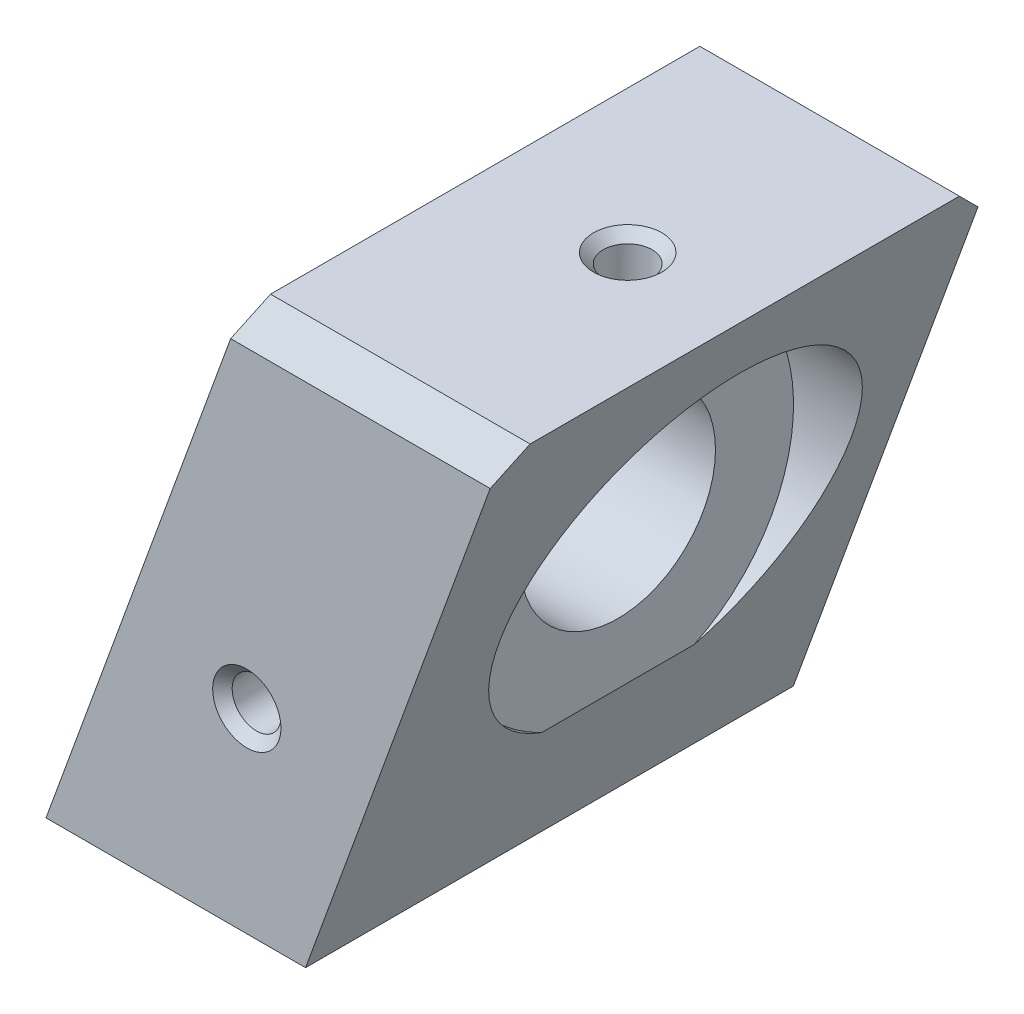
ISO-10303-21;
HEADER;
FILE_DESCRIPTION(('STEP AP214'),'2;1');
FILE_NAME('part.step','',(''),(''),'','','');
FILE_SCHEMA(('AUTOMOTIVE_DESIGN { 1 0 10303 214 1 1 1 1 }'));
ENDSEC;
DATA;
#1=APPLICATION_CONTEXT('core data for automotive mechanical design processes');
#2=APPLICATION_PROTOCOL_DEFINITION('international standard','automotive_design',2000,#1);
#3=PRODUCT_CONTEXT('',#1,'mechanical');
#4=PRODUCT('Part','Part','',(#3));
#5=PRODUCT_RELATED_PRODUCT_CATEGORY('part','',(#4));
#6=PRODUCT_DEFINITION_FORMATION('','',#4);
#7=PRODUCT_DEFINITION_CONTEXT('part definition',#1,'design');
#8=PRODUCT_DEFINITION('design','',#6,#7);
#9=PRODUCT_DEFINITION_SHAPE('','',#8);
#10=(LENGTH_UNIT() NAMED_UNIT(*) SI_UNIT(.MILLI.,.METRE.));
#11=(NAMED_UNIT(*) PLANE_ANGLE_UNIT() SI_UNIT($,.RADIAN.));
#12=(NAMED_UNIT(*) SI_UNIT($,.STERADIAN.) SOLID_ANGLE_UNIT());
#13=UNCERTAINTY_MEASURE_WITH_UNIT(LENGTH_MEASURE(1.E-05),#10,'distance_accuracy_value','');
#14=(GEOMETRIC_REPRESENTATION_CONTEXT(3) GLOBAL_UNCERTAINTY_ASSIGNED_CONTEXT((#13)) GLOBAL_UNIT_ASSIGNED_CONTEXT((#10,
#11,#12)) REPRESENTATION_CONTEXT('',''));
#15=CARTESIAN_POINT('',(0.,0.,0.));
#16=DIRECTION('',(0.,0.,1.));
#17=DIRECTION('',(1.,0.,0.));
#18=AXIS2_PLACEMENT_3D('',#15,#16,#17);
#19=CARTESIAN_POINT('',(0.,0.,25.));
#20=DIRECTION('',(0.939692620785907,-0.342020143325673,0.));
#21=DIRECTION('',(0.342020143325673,0.939692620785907,0.));
#22=AXIS2_PLACEMENT_3D('',#19,#20,#21);
#23=PLANE('',#22);
#24=CARTESIAN_POINT('',(10.9191070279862,30.,-2.));
#25=DIRECTION('',(0.939692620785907,-0.342020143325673,0.));
#26=DIRECTION('',(-0.342020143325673,-0.939692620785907,0.));
#27=AXIS2_PLACEMENT_3D('',#24,#25,#26);
#28=ELLIPSE('',#27,19.1551999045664,18.);
#29=CARTESIAN_POINT('',(17.,46.707116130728,4.69867677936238));
#30=VERTEX_POINT('',#29);
#31=CARTESIAN_POINT('',(4.42096958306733,12.1465141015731,0.291951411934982));
#32=VERTEX_POINT('',#31);
#33=EDGE_CURVE('E161',#30,#32,#28,.T.);
#34=ORIENTED_EDGE('',*,*,#33,.T.);
#35=CARTESIAN_POINT('',(8.,21.9798193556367,-2.));
#36=DIRECTION('',(0.939692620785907,-0.342020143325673,0.));
#37=DIRECTION('',(-0.342020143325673,-0.939692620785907,0.));
#38=AXIS2_PLACEMENT_3D('',#35,#36,#37);
#39=ELLIPSE('',#38,12.426168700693,4.25);
#40=CARTESIAN_POINT('',(4.42096958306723,12.1465141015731,-4.29195141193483));
#41=VERTEX_POINT('',#40);
#42=EDGE_CURVE('E66',#32,#41,#39,.T.);
#43=ORIENTED_EDGE('',*,*,#42,.T.);
#44=CARTESIAN_POINT('',(17.,46.707116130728,-8.69867677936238));
#45=VERTEX_POINT('',#44);
#46=EDGE_CURVE('E159',#41,#45,#28,.T.);
#47=ORIENTED_EDGE('',*,*,#46,.T.);
#48=DIRECTION('',(0.,0.,1.));
#49=VECTOR('',#48,1.);
#50=CARTESIAN_POINT('',(17.,46.707116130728,25.));
#51=LINE('',#50,#49);
#52=EDGE_CURVE('E426',#45,#30,#51,.T.);
#53=ORIENTED_EDGE('',*,*,#52,.T.);
#54=EDGE_LOOP('',(#34,#43,#47,#53));
#55=FACE_BOUND('',#54,.T.);
#56=DIRECTION('',(0.,0.,-1.));
#57=VECTOR('',#56,1.);
#58=CARTESIAN_POINT('',(20.0183628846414,55.,25.));
#59=LINE('',#58,#57);
#60=CARTESIAN_POINT('',(20.0183628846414,55.,22.));
#61=VERTEX_POINT('',#60);
#62=CARTESIAN_POINT('',(20.0183628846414,55.,-22.));
#63=VERTEX_POINT('',#62);
#64=EDGE_CURVE('E204',#61,#63,#59,.T.);
#65=ORIENTED_EDGE('',*,*,#64,.T.);
#66=DIRECTION('',(-0.249243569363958,-0.684791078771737,-0.684791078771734));
#67=VECTOR('',#66,1.);
#68=CARTESIAN_POINT('',(20.0183628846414,55.,-22.));
#69=LINE('',#68,#67);
#70=CARTESIAN_POINT('',(18.9264521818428,52.,-25.));
#71=VERTEX_POINT('',#70);
#72=EDGE_CURVE('E366',#63,#71,#69,.T.);
#73=ORIENTED_EDGE('',*,*,#72,.T.);
#74=DIRECTION('',(-0.342020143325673,-0.939692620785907,0.));
#75=VECTOR('',#74,1.);
#76=CARTESIAN_POINT('',(0.,0.,-25.));
#77=LINE('',#76,#75);
#78=CARTESIAN_POINT('',(0.,0.,-25.));
#79=VERTEX_POINT('',#78);
#80=EDGE_CURVE('E193',#71,#79,#77,.T.);
#81=ORIENTED_EDGE('',*,*,#80,.T.);
#82=DIRECTION('',(0.,0.,-1.));
#83=VECTOR('',#82,1.);
#84=CARTESIAN_POINT('',(0.,0.,25.));
#85=LINE('',#84,#83);
#86=CARTESIAN_POINT('',(0.,0.,25.));
#87=VERTEX_POINT('',#86);
#88=EDGE_CURVE('E224',#87,#79,#85,.T.);
#89=ORIENTED_EDGE('',*,*,#88,.F.);
#90=DIRECTION('',(-0.342020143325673,-0.939692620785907,0.));
#91=VECTOR('',#90,1.);
#92=CARTESIAN_POINT('',(0.,0.,25.));
#93=LINE('',#92,#91);
#94=CARTESIAN_POINT('',(18.9264521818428,52.,25.));
#95=VERTEX_POINT('',#94);
#96=EDGE_CURVE('E194',#95,#87,#93,.T.);
#97=ORIENTED_EDGE('',*,*,#96,.F.);
#98=DIRECTION('',(-0.249243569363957,-0.684791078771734,0.684791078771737));
#99=VECTOR('',#98,1.);
#100=CARTESIAN_POINT('',(18.9942842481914,52.1863670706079,24.8136329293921));
#101=LINE('',#100,#99);
#102=EDGE_CURVE('E369',#95,#61,#101,.F.);
#103=ORIENTED_EDGE('',*,*,#102,.T.);
#104=EDGE_LOOP('',(#65,#73,#81,#89,#97,#103));
#105=FACE_BOUND('',#104,.T.);
#106=ADVANCED_FACE('F45',(#55,#105),#23,.F.);
#107=CARTESIAN_POINT('',(0.,0.,25.));
#108=DIRECTION('',(0.,1.,0.));
#109=DIRECTION('',(0.,0.,1.));
#110=AXIS2_PLACEMENT_3D('',#107,#108,#109);
#111=PLANE('',#110);
#112=CARTESIAN_POINT('',(8.,0.,-2.));
#113=DIRECTION('',(0.,-1.,0.));
#114=DIRECTION('',(0.,0.,-1.));
#115=AXIS2_PLACEMENT_3D('',#112,#113,#114);
#116=CIRCLE('',#115,4.25);
#117=CARTESIAN_POINT('',(8.,0.,-6.25));
#118=VERTEX_POINT('',#117);
#119=EDGE_CURVE('E164',#118,#118,#116,.T.);
#120=ORIENTED_EDGE('',*,*,#119,.F.);
#121=EDGE_LOOP('',(#120));
#122=FACE_BOUND('',#121,.T.);
#123=CARTESIAN_POINT('',(15.,0.,-16.4));
#124=DIRECTION('',(0.,1.,0.));
#125=DIRECTION('',(0.,0.,1.));
#126=AXIS2_PLACEMENT_3D('',#123,#124,#125);
#127=CIRCLE('',#126,5.25000000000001);
#128=CARTESIAN_POINT('',(15.,0.,-11.15));
#129=VERTEX_POINT('',#128);
#130=EDGE_CURVE('E236',#129,#129,#127,.T.);
#131=ORIENTED_EDGE('',*,*,#130,.T.);
#132=EDGE_LOOP('',(#131));
#133=FACE_BOUND('',#132,.T.);
#134=CARTESIAN_POINT('',(15.,0.,13.6));
#135=DIRECTION('',(0.,1.,0.));
#136=DIRECTION('',(0.,0.,1.));
#137=AXIS2_PLACEMENT_3D('',#134,#135,#136);
#138=CIRCLE('',#137,5.25000000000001);
#139=CARTESIAN_POINT('',(15.,0.,18.85));
#140=VERTEX_POINT('',#139);
#141=EDGE_CURVE('E232',#140,#140,#138,.T.);
#142=ORIENTED_EDGE('',*,*,#141,.T.);
#143=EDGE_LOOP('',(#142));
#144=FACE_BOUND('',#143,.T.);
#145=DIRECTION('',(1.,0.,0.));
#146=VECTOR('',#145,1.);
#147=CARTESIAN_POINT('',(0.,0.,-25.));
#148=LINE('',#147,#146);
#149=CARTESIAN_POINT('',(26.6044443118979,0.,-25.));
#150=VERTEX_POINT('',#149);
#151=EDGE_CURVE('E207',#79,#150,#148,.T.);
#152=ORIENTED_EDGE('',*,*,#151,.T.);
#153=DIRECTION('',(0.,0.,-1.));
#154=VECTOR('',#153,1.);
#155=CARTESIAN_POINT('',(26.6044443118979,0.,25.));
#156=LINE('',#155,#154);
#157=CARTESIAN_POINT('',(26.6044443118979,0.,25.));
#158=VERTEX_POINT('',#157);
#159=EDGE_CURVE('E220',#158,#150,#156,.T.);
#160=ORIENTED_EDGE('',*,*,#159,.F.);
#161=DIRECTION('',(1.,0.,0.));
#162=VECTOR('',#161,1.);
#163=CARTESIAN_POINT('',(0.,0.,25.));
#164=LINE('',#163,#162);
#165=EDGE_CURVE('E197',#87,#158,#164,.T.);
#166=ORIENTED_EDGE('',*,*,#165,.F.);
#167=ORIENTED_EDGE('',*,*,#88,.T.);
#168=EDGE_LOOP('',(#152,#160,#166,#167));
#169=FACE_BOUND('',#168,.T.);
#170=ADVANCED_FACE('F451',(#122,#133,#144,#169),#111,.F.);
#171=CARTESIAN_POINT('',(46.6228071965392,55.,25.));
#172=DIRECTION('',(-0.939692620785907,0.342020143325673,0.));
#173=DIRECTION('',(-0.342020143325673,-0.939692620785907,0.));
#174=AXIS2_PLACEMENT_3D('',#171,#172,#173);
#175=PLANE('',#174);
#176=CARTESIAN_POINT('',(37.5235513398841,30.,-2.));
#177=DIRECTION('',(-0.939692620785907,0.342020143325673,0.));
#178=DIRECTION('',(-0.342020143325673,-0.939692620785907,0.));
#179=AXIS2_PLACEMENT_3D('',#176,#177,#178);
#180=ELLIPSE('',#179,19.1551999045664,18.);
#181=CARTESIAN_POINT('',(31.6228071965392,13.7878387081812,5.82085840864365));
#182=VERTEX_POINT('',#181);
#183=CARTESIAN_POINT('',(31.6228071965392,13.7878387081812,-9.82085840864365));
#184=VERTEX_POINT('',#183);
#185=EDGE_CURVE('E257',#182,#184,#180,.T.);
#186=ORIENTED_EDGE('',*,*,#185,.T.);
#187=DIRECTION('',(0.,0.,1.));
#188=VECTOR('',#187,1.);
#189=CARTESIAN_POINT('',(31.6228071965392,13.7878387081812,25.));
#190=LINE('',#189,#188);
#191=EDGE_CURVE('E378',#184,#182,#190,.T.);
#192=ORIENTED_EDGE('',*,*,#191,.T.);
#193=EDGE_LOOP('',(#186,#192));
#194=FACE_BOUND('',#193,.T.);
#195=DIRECTION('',(0.342020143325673,0.939692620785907,0.));
#196=VECTOR('',#195,1.);
#197=CARTESIAN_POINT('',(46.6228071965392,55.,-25.));
#198=LINE('',#197,#196);
#199=CARTESIAN_POINT('',(45.5308964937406,52.,-25.));
#200=VERTEX_POINT('',#199);
#201=EDGE_CURVE('E198',#150,#200,#198,.T.);
#202=ORIENTED_EDGE('',*,*,#201,.T.);
#203=DIRECTION('',(0.249243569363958,0.684791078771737,0.684791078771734));
#204=VECTOR('',#203,1.);
#205=CARTESIAN_POINT('',(44.9700764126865,50.459159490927,-26.5408405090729));
#206=LINE('',#205,#204);
#207=CARTESIAN_POINT('',(46.6228071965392,55.,-22.));
#208=VERTEX_POINT('',#207);
#209=EDGE_CURVE('E354',#200,#208,#206,.T.);
#210=ORIENTED_EDGE('',*,*,#209,.T.);
#211=DIRECTION('',(0.,0.,-1.));
#212=VECTOR('',#211,1.);
#213=CARTESIAN_POINT('',(46.6228071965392,55.,25.));
#214=LINE('',#213,#212);
#215=CARTESIAN_POINT('',(46.6228071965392,55.,22.));
#216=VERTEX_POINT('',#215);
#217=EDGE_CURVE('E216',#216,#208,#214,.T.);
#218=ORIENTED_EDGE('',*,*,#217,.F.);
#219=DIRECTION('',(0.249243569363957,0.684791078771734,-0.684791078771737));
#220=VECTOR('',#219,1.);
#221=CARTESIAN_POINT('',(43.9459977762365,47.645526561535,29.3544734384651));
#222=LINE('',#221,#220);
#223=CARTESIAN_POINT('',(45.5308964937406,52.,25.));
#224=VERTEX_POINT('',#223);
#225=EDGE_CURVE('E73',#216,#224,#222,.F.);
#226=ORIENTED_EDGE('',*,*,#225,.T.);
#227=DIRECTION('',(0.342020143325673,0.939692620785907,0.));
#228=VECTOR('',#227,1.);
#229=CARTESIAN_POINT('',(46.6228071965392,55.,25.));
#230=LINE('',#229,#228);
#231=EDGE_CURVE('E201',#158,#224,#230,.T.);
#232=ORIENTED_EDGE('',*,*,#231,.F.);
#233=ORIENTED_EDGE('',*,*,#159,.T.);
#234=EDGE_LOOP('',(#202,#210,#218,#226,#232,#233));
#235=FACE_BOUND('',#234,.T.);
#236=ADVANCED_FACE('F385',(#194,#235),#175,.F.);
#237=CARTESIAN_POINT('',(20.0183628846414,55.,25.));
#238=DIRECTION('',(0.,-1.,0.));
#239=DIRECTION('',(0.,0.,-1.));
#240=AXIS2_PLACEMENT_3D('',#237,#238,#239);
#241=PLANE('',#240);
#242=CARTESIAN_POINT('',(34.6228071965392,55.,0.));
#243=DIRECTION('',(0.,-1.,0.));
#244=DIRECTION('',(0.,0.,-1.));
#245=AXIS2_PLACEMENT_3D('',#242,#243,#244);
#246=CIRCLE('',#245,3.49999999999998);
#247=CARTESIAN_POINT('',(34.6228071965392,55.,-3.49999999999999));
#248=VERTEX_POINT('',#247);
#249=EDGE_CURVE('E60',#248,#248,#246,.T.);
#250=ORIENTED_EDGE('',*,*,#249,.T.);
#251=EDGE_LOOP('',(#250));
#252=FACE_BOUND('',#251,.T.);
#253=ORIENTED_EDGE('',*,*,#217,.T.);
#254=DIRECTION('',(-1.,0.,0.));
#255=VECTOR('',#254,1.);
#256=CARTESIAN_POINT('',(20.0183628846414,55.,-22.));
#257=LINE('',#256,#255);
#258=EDGE_CURVE('E372',#208,#63,#257,.T.);
#259=ORIENTED_EDGE('',*,*,#258,.T.);
#260=ORIENTED_EDGE('',*,*,#64,.F.);
#261=DIRECTION('',(1.,0.,0.));
#262=VECTOR('',#261,1.);
#263=CARTESIAN_POINT('',(20.0183628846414,55.,22.));
#264=LINE('',#263,#262);
#265=EDGE_CURVE('E376',#61,#216,#264,.T.);
#266=ORIENTED_EDGE('',*,*,#265,.T.);
#267=EDGE_LOOP('',(#253,#259,#260,#266));
#268=FACE_BOUND('',#267,.T.);
#269=ADVANCED_FACE('F599',(#252,#268),#241,.F.);
#270=CARTESIAN_POINT('',(20.0183628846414,55.,25.));
#271=DIRECTION('',(0.,0.,-1.));
#272=DIRECTION('',(-1.,0.,0.));
#273=AXIS2_PLACEMENT_3D('',#270,#271,#272);
#274=PLANE('',#273);
#275=CARTESIAN_POINT('',(20.5816268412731,20.,25.));
#276=DIRECTION('',(0.,0.,-1.));
#277=DIRECTION('',(-1.,0.,0.));
#278=AXIS2_PLACEMENT_3D('',#275,#276,#277);
#279=CIRCLE('',#278,3.5);
#280=CARTESIAN_POINT('',(17.0816268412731,20.,25.));
#281=VERTEX_POINT('',#280);
#282=EDGE_CURVE('E309',#281,#281,#279,.T.);
#283=ORIENTED_EDGE('',*,*,#282,.T.);
#284=EDGE_LOOP('',(#283));
#285=FACE_BOUND('',#284,.T.);
#286=ORIENTED_EDGE('',*,*,#231,.T.);
#287=DIRECTION('',(-1.,0.,0.));
#288=VECTOR('',#287,1.);
#289=CARTESIAN_POINT('',(20.0183628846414,52.,25.));
#290=LINE('',#289,#288);
#291=EDGE_CURVE('E344',#224,#95,#290,.T.);
#292=ORIENTED_EDGE('',*,*,#291,.T.);
#293=ORIENTED_EDGE('',*,*,#96,.T.);
#294=ORIENTED_EDGE('',*,*,#165,.T.);
#295=EDGE_LOOP('',(#286,#292,#293,#294));
#296=FACE_BOUND('',#295,.T.);
#297=ADVANCED_FACE('F447',(#285,#296),#274,.F.);
#298=CARTESIAN_POINT('',(20.0183628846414,55.,-25.));
#299=DIRECTION('',(0.,0.,-1.));
#300=DIRECTION('',(-1.,0.,0.));
#301=AXIS2_PLACEMENT_3D('',#298,#299,#300);
#302=PLANE('',#301);
#303=CARTESIAN_POINT('',(20.5816268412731,20.,-25.));
#304=DIRECTION('',(0.,0.,-1.));
#305=DIRECTION('',(-1.,0.,0.));
#306=AXIS2_PLACEMENT_3D('',#303,#304,#305);
#307=CIRCLE('',#306,3.5);
#308=CARTESIAN_POINT('',(17.0816268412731,20.,-25.));
#309=VERTEX_POINT('',#308);
#310=EDGE_CURVE('E487',#309,#309,#307,.F.);
#311=ORIENTED_EDGE('',*,*,#310,.T.);
#312=EDGE_LOOP('',(#311));
#313=FACE_BOUND('',#312,.T.);
#314=ORIENTED_EDGE('',*,*,#80,.F.);
#315=DIRECTION('',(1.,0.,0.));
#316=VECTOR('',#315,1.);
#317=CARTESIAN_POINT('',(46.6228071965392,52.,-25.));
#318=LINE('',#317,#316);
#319=EDGE_CURVE('E361',#71,#200,#318,.T.);
#320=ORIENTED_EDGE('',*,*,#319,.T.);
#321=ORIENTED_EDGE('',*,*,#201,.F.);
#322=ORIENTED_EDGE('',*,*,#151,.F.);
#323=EDGE_LOOP('',(#314,#320,#321,#322));
#324=FACE_BOUND('',#323,.T.);
#325=ADVANCED_FACE('F443',(#313,#324),#302,.T.);
#326=CARTESIAN_POINT('',(15.,24.5,-16.4));
#327=DIRECTION('',(0.,-1.,0.));
#328=DIRECTION('',(0.,0.,-1.));
#329=AXIS2_PLACEMENT_3D('',#326,#327,#328);
#330=CONICAL_SURFACE('',#329,4.25,1.02974425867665);
#331=CARTESIAN_POINT('',(17.,14.8469578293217,-36.616672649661));
#332=CARTESIAN_POINT('',(17.,15.2568777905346,-35.9310968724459));
#333=CARTESIAN_POINT('',(17.,15.6666691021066,-35.2454440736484));
#334=CARTESIAN_POINT('',(17.,16.4858738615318,-33.873828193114));
#335=CARTESIAN_POINT('',(17.,16.8952872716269,-33.1878650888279));
#336=CARTESIAN_POINT('',(17.,17.7143758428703,-31.8141970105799));
#337=CARTESIAN_POINT('',(17.,18.1240498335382,-31.1264913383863));
#338=CARTESIAN_POINT('',(17.,18.9424901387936,-29.7506230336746));
#339=CARTESIAN_POINT('',(17.,19.351256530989,-29.0624604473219));
#340=CARTESIAN_POINT('',(17.,20.1994711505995,-27.6312701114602));
#341=CARTESIAN_POINT('',(17.,20.6388086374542,-26.8881766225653));
#342=CARTESIAN_POINT('',(17.,21.2956835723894,-25.7721395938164));
#343=CARTESIAN_POINT('',(17.,21.5143174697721,-25.3998416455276));
#344=CARTESIAN_POINT('',(17.,21.9505200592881,-24.6546353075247));
#345=CARTESIAN_POINT('',(17.,22.1680887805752,-24.2817269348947));
#346=CARTESIAN_POINT('',(17.,22.6013578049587,-23.5355027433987));
#347=CARTESIAN_POINT('',(17.,22.8170602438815,-23.1621881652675));
#348=CARTESIAN_POINT('',(17.,23.2460398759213,-22.4141095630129));
#349=CARTESIAN_POINT('',(17.,23.459316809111,-22.0393453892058));
#350=CARTESIAN_POINT('',(17.,23.7759988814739,-21.4755031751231));
#351=CARTESIAN_POINT('',(17.,23.8809952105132,-21.2873196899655));
#352=CARTESIAN_POINT('',(17.,24.0895253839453,-20.9101450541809));
#353=CARTESIAN_POINT('',(17.,24.1930592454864,-20.721153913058));
#354=CARTESIAN_POINT('',(17.,24.3980640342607,-20.3420964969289));
#355=CARTESIAN_POINT('',(17.,24.4995353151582,-20.1520304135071));
#356=CARTESIAN_POINT('',(17.,24.699508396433,-19.7703457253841));
#357=CARTESIAN_POINT('',(17.,24.7980103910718,-19.578727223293));
#358=CARTESIAN_POINT('',(17.,24.9309262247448,-19.3124646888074));
#359=CARTESIAN_POINT('',(17.,24.9672881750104,-19.2387933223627));
#360=CARTESIAN_POINT('',(17.,25.0392127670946,-19.0910597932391));
#361=CARTESIAN_POINT('',(17.,25.0747753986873,-19.0169976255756));
#362=CARTESIAN_POINT('',(17.,25.1449519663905,-18.8684054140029));
#363=CARTESIAN_POINT('',(17.,25.1795657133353,-18.7938752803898));
#364=CARTESIAN_POINT('',(17.,25.2476297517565,-18.6442856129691));
#365=CARTESIAN_POINT('',(17.,25.2810800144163,-18.5692260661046));
#366=CARTESIAN_POINT('',(17.,25.3793706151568,-18.3430448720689));
#367=CARTESIAN_POINT('',(17.,25.4421171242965,-18.190990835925));
#368=CARTESIAN_POINT('',(17.,25.5298378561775,-17.9604806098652));
#369=CARTESIAN_POINT('',(17.,25.5580078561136,-17.8832507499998));
#370=CARTESIAN_POINT('',(17.,25.6116935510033,-17.7278741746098));
#371=CARTESIAN_POINT('',(17.,25.6372084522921,-17.6497271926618));
#372=CARTESIAN_POINT('',(17.,25.7250151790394,-17.3604695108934));
#373=CARTESIAN_POINT('',(17.,25.7773210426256,-17.1459011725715));
#374=CARTESIAN_POINT('',(17.,25.8272318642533,-16.8207031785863));
#375=CARTESIAN_POINT('',(17.,25.8391207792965,-16.7122632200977));
#376=CARTESIAN_POINT('',(17.,25.8523434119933,-16.4947225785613));
#377=CARTESIAN_POINT('',(17.,25.8536787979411,-16.3856220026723));
#378=CARTESIAN_POINT('',(17.,25.8456293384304,-16.1677354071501));
#379=CARTESIAN_POINT('',(17.,25.8362344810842,-16.0589497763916));
#380=CARTESIAN_POINT('',(17.,25.8077608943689,-15.8426334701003));
#381=CARTESIAN_POINT('',(17.,25.7886775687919,-15.7351034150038));
#382=CARTESIAN_POINT('',(17.,25.7539591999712,-15.5745461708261));
#383=CARTESIAN_POINT('',(17.,25.7412819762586,-15.5208500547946));
#384=CARTESIAN_POINT('',(17.,25.7141314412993,-15.4139331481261));
#385=CARTESIAN_POINT('',(17.,25.699658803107,-15.3607121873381));
#386=CARTESIAN_POINT('',(17.,25.6691348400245,-15.2547253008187));
#387=CARTESIAN_POINT('',(17.,25.6530834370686,-15.2019593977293));
#388=CARTESIAN_POINT('',(17.,25.6196035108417,-15.0968649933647));
#389=CARTESIAN_POINT('',(17.,25.6021749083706,-15.0445365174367));
#390=CARTESIAN_POINT('',(17.,25.543901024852,-14.8760145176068));
#391=CARTESIAN_POINT('',(17.,25.5006825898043,-14.7606401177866));
#392=CARTESIAN_POINT('',(17.,25.4099377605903,-14.5315882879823));
#393=CARTESIAN_POINT('',(17.,25.3624101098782,-14.4179113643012));
#394=CARTESIAN_POINT('',(17.,25.2641499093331,-14.1918303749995));
#395=CARTESIAN_POINT('',(17.,25.2134143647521,-14.0794276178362));
#396=CARTESIAN_POINT('',(17.,25.1095925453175,-13.8557340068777));
#397=CARTESIAN_POINT('',(17.,25.0565065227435,-13.7444430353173));
#398=CARTESIAN_POINT('',(17.,24.9483893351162,-13.5224072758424));
#399=CARTESIAN_POINT('',(17.,24.8933529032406,-13.4116650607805));
#400=CARTESIAN_POINT('',(17.,24.7818899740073,-13.1908812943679));
#401=CARTESIAN_POINT('',(17.,24.7254634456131,-13.0808397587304));
#402=CARTESIAN_POINT('',(17.,24.5546299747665,-12.751676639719));
#403=CARTESIAN_POINT('',(17.,24.4386085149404,-12.5333938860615));
#404=CARTESIAN_POINT('',(17.,24.2033662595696,-12.0974837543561));
#405=CARTESIAN_POINT('',(17.,24.0841348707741,-11.8798621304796));
#406=CARTESIAN_POINT('',(17.,23.8437689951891,-11.445637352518));
#407=CARTESIAN_POINT('',(17.,23.7226342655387,-11.2290343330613));
#408=CARTESIAN_POINT('',(17.,23.4792583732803,-10.7969794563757));
#409=CARTESIAN_POINT('',(17.,23.3570196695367,-10.5815262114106));
#410=CARTESIAN_POINT('',(17.,23.1115752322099,-10.1511835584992));
#411=CARTESIAN_POINT('',(17.,22.9883695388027,-9.9362941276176));
#412=CARTESIAN_POINT('',(17.,22.6959088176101,-9.42819662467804));
#413=CARTESIAN_POINT('',(17.,22.5263378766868,-9.13517049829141));
#414=CARTESIAN_POINT('',(17.,22.1862390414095,-8.54967384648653));
#415=CARTESIAN_POINT('',(17.,22.0157111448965,-8.25720332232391));
#416=CARTESIAN_POINT('',(17.,21.5030886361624,-7.38038345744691));
#417=CARTESIAN_POINT('',(17.,21.1599620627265,-6.79663768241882));
#418=CARTESIAN_POINT('',(17.,20.471861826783,-5.62960737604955));
#419=CARTESIAN_POINT('',(17.,20.1268869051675,-5.0463235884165));
#420=CARTESIAN_POINT('',(17.,19.4359345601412,-3.88035650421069));
#421=CARTESIAN_POINT('',(17.,19.08995714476,-3.29767320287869));
#422=CARTESIAN_POINT('',(17.,18.4051076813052,-2.14578725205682));
#423=CARTESIAN_POINT('',(17.,18.0662505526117,-1.57657572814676));
#424=CARTESIAN_POINT('',(17.,17.3880795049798,-0.438422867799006));
#425=CARTESIAN_POINT('',(17.,17.0487655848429,0.130518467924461));
#426=CARTESIAN_POINT('',(17.,16.3700891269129,1.26772647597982));
#427=CARTESIAN_POINT('',(17.,16.0307268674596,1.83599331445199));
#428=CARTESIAN_POINT('',(17.,15.3517476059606,2.97237252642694));
#429=CARTESIAN_POINT('',(17.,15.0121306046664,3.54048490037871));
#430=CARTESIAN_POINT('',(17.,14.6724239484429,4.10854361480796));
#431=B_SPLINE_CURVE_WITH_KNOTS('',3,(#331,#332,#333,#334,#335,#336,#337,#338,#339,#340,#341,
#342,#343,#344,#345,#346,#347,#348,#349,#350,#351,#352,#353,#354,#355,#356,#357,#358,#359,#360,
#361,#362,#363,#364,#365,#366,#367,#368,#369,#370,#371,#372,#373,#374,#375,#376,#377,#378,#379,
#380,#381,#382,#383,#384,#385,#386,#387,#388,#389,#390,#391,#392,#393,#394,#395,#396,#397,#398,
#399,#400,#401,#402,#403,#404,#405,#406,#407,#408,#409,#410,#411,#412,#413,#414,#415,#416,#417,
#418,#419,#420,#421,#422,#423,#424,#425,#426,#427,#428,#429,#430),.UNSPECIFIED.,.F.,.F.,(4,2,2,
2,2,2,2,2,2,2,2,2,2,2,2,2,2,2,2,2,2,2,2,2,2,2,2,2,2,2,2,2,2,2,2,2,2,2,2,2,2,2,2,2,2,2,2,2,2,4),
(0.,2.39633828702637,4.79289452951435,7.19434083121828,9.59557320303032,12.1853269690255,
13.4805706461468,14.7757786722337,16.0692280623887,17.3628147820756,18.0092896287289,
18.6557568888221,19.3021123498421,19.9484254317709,20.1948905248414,20.4413587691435,
20.6878757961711,20.9343989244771,21.4276785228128,21.674244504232,21.9208839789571,
22.5806550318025,22.9074850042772,23.2342633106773,23.5613467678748,23.8885855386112,
24.054078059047,24.2195087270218,24.3849475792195,24.5503959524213,24.9198683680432,
25.2894488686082,25.6593796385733,26.0292707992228,26.400251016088,26.7712395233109,
27.5128061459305,28.2572263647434,29.0017423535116,29.7448822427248,30.4879914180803,
31.5036497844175,32.5193104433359,34.5506728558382,36.5836619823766,38.6166348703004,
40.6039527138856,42.5912757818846,44.5769356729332,46.5625897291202),.UNSPECIFIED.);
#432=CARTESIAN_POINT('',(17.,24.5,-12.65));
#433=VERTEX_POINT('',#432);
#434=CARTESIAN_POINT('',(17.,24.9484955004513,-19.2766403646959));
#435=VERTEX_POINT('',#434);
#436=EDGE_CURVE('E419',#433,#435,#431,.F.);
#437=ORIENTED_EDGE('',*,*,#436,.T.);
#438=CARTESIAN_POINT('',(18.8997737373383,24.2215514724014,-19.0472734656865));
#439=CARTESIAN_POINT('',(18.7960828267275,24.2677994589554,-19.0629512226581));
#440=CARTESIAN_POINT('',(18.692041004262,24.3134156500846,-19.078202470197));
#441=CARTESIAN_POINT('',(18.48316695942,24.4031143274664,-19.1078078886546));
#442=CARTESIAN_POINT('',(18.3783347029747,24.447196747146,-19.1221620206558));
#443=CARTESIAN_POINT('',(18.1660676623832,24.5342643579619,-19.1501562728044));
#444=CARTESIAN_POINT('',(18.0586184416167,24.577219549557,-19.1637807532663));
#445=CARTESIAN_POINT('',(17.8426970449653,24.6609013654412,-19.1899957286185));
#446=CARTESIAN_POINT('',(17.7342245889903,24.7016273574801,-19.2025859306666));
#447=CARTESIAN_POINT('',(17.4071655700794,24.8198170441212,-19.2386906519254));
#448=CARTESIAN_POINT('',(17.1869229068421,24.8932984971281,-19.2605412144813));
#449=CARTESIAN_POINT('',(16.7412890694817,25.0250675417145,-19.2989821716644));
#450=CARTESIAN_POINT('',(16.5158974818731,25.0833539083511,-19.3155721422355));
#451=CARTESIAN_POINT('',(16.1755304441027,25.1546626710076,-19.3356081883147));
#452=CARTESIAN_POINT('',(16.0623619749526,25.1756688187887,-19.341458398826));
#453=CARTESIAN_POINT('',(15.8350265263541,25.2118048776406,-19.3514708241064));
#454=CARTESIAN_POINT('',(15.7208597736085,25.2269360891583,-19.3556334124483));
#455=CARTESIAN_POINT('',(15.4918839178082,25.2507148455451,-19.3621555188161));
#456=CARTESIAN_POINT('',(15.3770753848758,25.2593674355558,-19.3645164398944));
#457=CARTESIAN_POINT('',(15.1471231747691,25.2698225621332,-19.3673674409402));
#458=CARTESIAN_POINT('',(15.031979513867,25.2716254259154,-19.3678576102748));
#459=CARTESIAN_POINT('',(14.8125498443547,25.2684538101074,-19.3669937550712));
#460=CARTESIAN_POINT('',(14.7082537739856,25.2640963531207,-19.3658076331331));
#461=CARTESIAN_POINT('',(14.500078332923,25.2498578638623,-19.3619181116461));
#462=CARTESIAN_POINT('',(14.3961989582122,25.2399768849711,-19.3592147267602));
#463=CARTESIAN_POINT('',(14.085462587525,25.2025240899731,-19.3489169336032));
#464=CARTESIAN_POINT('',(13.8795932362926,25.1671441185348,-19.3391353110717));
#465=CARTESIAN_POINT('',(13.4701611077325,25.0793061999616,-19.3144109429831));
#466=CARTESIAN_POINT('',(13.266633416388,25.0267039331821,-19.2994245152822));
#467=CARTESIAN_POINT('',(12.8637425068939,24.9088914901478,-19.2651203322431));
#468=CARTESIAN_POINT('',(12.6643787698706,24.8436828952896,-19.2458031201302));
#469=CARTESIAN_POINT('',(12.242948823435,24.6948329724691,-19.2006399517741));
#470=CARTESIAN_POINT('',(12.0214041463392,24.6098930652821,-19.1742667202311));
#471=CARTESIAN_POINT('',(11.69255836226,24.4766295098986,-19.131682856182));
#472=CARTESIAN_POINT('',(11.5837920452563,24.4313543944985,-19.1170250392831));
#473=CARTESIAN_POINT('',(11.367112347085,24.3391010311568,-19.0867368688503));
#474=CARTESIAN_POINT('',(11.2591990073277,24.292122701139,-19.0711064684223));
#475=CARTESIAN_POINT('',(10.950181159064,24.155075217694,-19.024856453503));
#476=CARTESIAN_POINT('',(10.7500416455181,24.0632228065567,-18.9930735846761));
#477=CARTESIAN_POINT('',(10.3519832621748,23.8758684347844,-18.9264558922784));
#478=CARTESIAN_POINT('',(10.1540645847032,23.7803661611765,-18.8916208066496));
#479=CARTESIAN_POINT('',(9.76002891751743,23.586595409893,-18.8190057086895));
#480=CARTESIAN_POINT('',(9.56391271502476,23.4883257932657,-18.7812244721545));
#481=CARTESIAN_POINT('',(9.17330802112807,23.2897147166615,-18.7027983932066));
#482=CARTESIAN_POINT('',(8.97881955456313,23.1893732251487,-18.6621535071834));
#483=CARTESIAN_POINT('',(8.58972065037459,22.9862764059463,-18.577692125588));
#484=CARTESIAN_POINT('',(8.39512199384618,22.8835081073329,-18.5338525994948));
#485=CARTESIAN_POINT('',(8.00726499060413,22.6767110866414,-18.4433020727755));
#486=CARTESIAN_POINT('',(7.81400665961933,22.5726823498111,-18.3965910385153));
#487=CARTESIAN_POINT('',(7.42895097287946,22.3637530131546,-18.3003357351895));
#488=CARTESIAN_POINT('',(7.2371522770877,22.2588534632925,-18.2507945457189));
#489=CARTESIAN_POINT('',(6.85476621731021,22.048276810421,-18.1488017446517));
#490=CARTESIAN_POINT('',(6.66417882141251,21.9425997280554,-18.0963502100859));
#491=CARTESIAN_POINT('',(6.47417140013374,21.8366330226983,-18.0424262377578));
#492=B_SPLINE_CURVE_WITH_KNOTS('',3,(#438,#439,#440,#441,#442,#443,#444,#445,#446,#447,#448,
#449,#450,#451,#452,#453,#454,#455,#456,#457,#458,#459,#460,#461,#462,#463,#464,#465,#466,#467,
#468,#469,#470,#471,#472,#473,#474,#475,#476,#477,#478,#479,#480,#481,#482,#483,#484,#485,#486,
#487,#488,#489,#490,#491),.UNSPECIFIED.,.F.,.F.,(4,2,2,2,2,2,2,2,2,2,2,2,2,2,2,2,2,2,2,2,2,2,2,
2,2,2,4),(0.,0.343846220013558,0.68770734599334,1.03722786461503,1.38684700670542,
2.08603799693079,2.78528533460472,3.13089670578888,3.47643153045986,3.82169699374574,
4.16694596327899,4.47996228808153,4.79297558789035,5.41925856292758,6.05093007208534,
6.68252239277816,7.39841577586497,7.75456766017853,8.11073672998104,8.77812913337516,
9.44557889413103,10.1133074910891,10.7810462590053,11.4541956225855,12.1273528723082,
12.799791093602,13.4722115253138),.UNSPECIFIED.);
#493=CARTESIAN_POINT('',(11.7504413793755,24.5,-19.1391365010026));
#494=VERTEX_POINT('',#493);
#495=EDGE_CURVE('E171',#435,#494,#492,.T.);
#496=ORIENTED_EDGE('',*,*,#495,.T.);
#497=CARTESIAN_POINT('',(15.,24.5,-16.4));
#498=DIRECTION('',(0.,-1.,0.));
#499=DIRECTION('',(0.,0.,-1.));
#500=AXIS2_PLACEMENT_3D('',#497,#498,#499);
#501=CIRCLE('',#500,4.25);
#502=EDGE_CURVE('E189',#494,#433,#501,.T.);
#503=ORIENTED_EDGE('',*,*,#502,.T.);
#504=EDGE_LOOP('',(#437,#496,#503));
#505=FACE_BOUND('',#504,.T.);
#506=ADVANCED_FACE('F291',(#505),#330,.F.);
#507=CARTESIAN_POINT('',(15.,0.,-16.4));
#508=DIRECTION('',(0.,-1.,0.));
#509=DIRECTION('',(0.,0.,-1.));
#510=AXIS2_PLACEMENT_3D('',#507,#508,#509);
#511=CYLINDRICAL_SURFACE('',#510,4.25);
#512=CARTESIAN_POINT('',(18.0816268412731,20.,-13.4732140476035));
#513=CARTESIAN_POINT('',(18.0816284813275,19.8991023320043,-13.4732141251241));
#514=CARTESIAN_POINT('',(18.0877774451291,19.7981884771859,-13.4796490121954));
#515=CARTESIAN_POINT('',(18.1118924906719,19.5994525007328,-13.5053623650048));
#516=CARTESIAN_POINT('',(18.1298611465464,19.5016310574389,-13.5246436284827));
#517=CARTESIAN_POINT('',(18.1761461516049,19.3121322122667,-13.5758588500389));
#518=CARTESIAN_POINT('',(18.2044455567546,19.2204450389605,-13.607772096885));
#519=CARTESIAN_POINT('',(18.2691576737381,19.0454330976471,-13.6838287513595));
#520=CARTESIAN_POINT('',(18.3055701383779,18.9621080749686,-13.7279717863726));
#521=CARTESIAN_POINT('',(18.384157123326,18.8046068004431,-13.8282176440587));
#522=CARTESIAN_POINT('',(18.4263895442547,18.7305388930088,-13.884444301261));
#523=CARTESIAN_POINT('',(18.5132996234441,18.5933626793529,-14.0073264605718));
#524=CARTESIAN_POINT('',(18.5579778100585,18.5302567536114,-14.073984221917));
#525=CARTESIAN_POINT('',(18.6524410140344,18.4078520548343,-14.2249090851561));
#526=CARTESIAN_POINT('',(18.7021845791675,18.3499553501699,-14.3103322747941));
#527=CARTESIAN_POINT('',(18.798140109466,18.246671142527,-14.4902765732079));
#528=CARTESIAN_POINT('',(18.8443486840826,18.201295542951,-14.584806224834));
#529=CARTESIAN_POINT('',(18.9202917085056,18.1313292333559,-14.7567205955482));
#530=CARTESIAN_POINT('',(18.9512847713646,18.1043708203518,-14.8326133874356));
#531=CARTESIAN_POINT('',(19.0093115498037,18.0559695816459,-14.9876372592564));
#532=CARTESIAN_POINT('',(19.0363436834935,18.0345289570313,-15.0667696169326));
#533=CARTESIAN_POINT('',(19.0859731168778,17.9965035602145,-15.2276426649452));
#534=CARTESIAN_POINT('',(19.108565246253,17.9799244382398,-15.3093862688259));
#535=CARTESIAN_POINT('',(19.1489469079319,17.9510872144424,-15.4748029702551));
#536=CARTESIAN_POINT('',(19.1667358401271,17.9388296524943,-15.5584763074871));
#537=CARTESIAN_POINT('',(19.1975160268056,17.9180327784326,-15.7284829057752));
#538=CARTESIAN_POINT('',(19.2104304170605,17.909552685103,-15.8148372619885));
#539=CARTESIAN_POINT('',(19.2309302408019,17.896249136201,-15.9884530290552));
#540=CARTESIAN_POINT('',(19.2385155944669,17.8914257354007,-16.0757144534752));
#541=CARTESIAN_POINT('',(19.248280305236,17.8852374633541,-16.2506872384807));
#542=CARTESIAN_POINT('',(19.2504580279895,17.8838736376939,-16.3383987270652));
#543=CARTESIAN_POINT('',(19.2493818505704,17.8845513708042,-16.5137744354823));
#544=CARTESIAN_POINT('',(19.2461278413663,17.8865929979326,-16.6014386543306));
#545=CARTESIAN_POINT('',(19.2333688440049,17.894704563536,-16.7887233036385));
#546=CARTESIAN_POINT('',(19.2230387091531,17.9013073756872,-16.8882662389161));
#547=CARTESIAN_POINT('',(19.1954638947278,17.9194173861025,-17.0859628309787));
#548=CARTESIAN_POINT('',(19.178217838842,17.9309255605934,-17.1841162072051));
#549=CARTESIAN_POINT('',(19.1370939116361,17.9594239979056,-17.3781523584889));
#550=CARTESIAN_POINT('',(19.1132204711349,17.9764105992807,-17.4740366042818));
#551=CARTESIAN_POINT('',(19.0592797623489,18.0166711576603,-17.6626790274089));
#552=CARTESIAN_POINT('',(19.0292151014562,18.0399424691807,-17.755438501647));
#553=CARTESIAN_POINT('',(18.9729972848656,18.0860454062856,-17.910805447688));
#554=CARTESIAN_POINT('',(18.9481921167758,18.1070920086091,-17.9744360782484));
#555=CARTESIAN_POINT('',(18.8961434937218,18.1532846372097,-18.0991550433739));
#556=CARTESIAN_POINT('',(18.8689006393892,18.1784296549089,-18.1602439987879));
#557=CARTESIAN_POINT('',(18.8124695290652,18.2331880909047,-18.2793373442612));
#558=CARTESIAN_POINT('',(18.783284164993,18.2627949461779,-18.3373460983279));
#559=CARTESIAN_POINT('',(18.7235329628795,18.3268573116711,-18.4498454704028));
#560=CARTESIAN_POINT('',(18.6929673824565,18.3613119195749,-18.504336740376));
#561=CARTESIAN_POINT('',(18.611907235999,18.4584669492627,-18.6419494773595));
#562=CARTESIAN_POINT('',(18.5608311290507,18.5254152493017,-18.7218210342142));
#563=CARTESIAN_POINT('',(18.4606718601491,18.6735311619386,-18.8686377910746));
#564=CARTESIAN_POINT('',(18.4115881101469,18.754694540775,-18.935586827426));
#565=CARTESIAN_POINT('',(18.3194681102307,18.9310829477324,-19.0550665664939));
#566=CARTESIAN_POINT('',(18.2764739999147,19.0263974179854,-19.1074989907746));
#567=CARTESIAN_POINT('',(18.2012915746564,19.228265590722,-19.196004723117));
#568=CARTESIAN_POINT('',(18.169098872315,19.3348147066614,-19.2320846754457));
#569=CARTESIAN_POINT('',(18.1218342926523,19.5423927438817,-19.2840485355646));
#570=CARTESIAN_POINT('',(18.1051962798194,19.6426014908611,-19.3018059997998));
#571=CARTESIAN_POINT('',(18.0843054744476,19.8457426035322,-19.3240045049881));
#572=CARTESIAN_POINT('',(18.0800485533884,19.9486740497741,-19.3284499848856));
#573=CARTESIAN_POINT('',(18.0841490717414,20.1486185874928,-19.3241279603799));
#574=CARTESIAN_POINT('',(18.0918618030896,20.2456609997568,-19.3160357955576));
#575=CARTESIAN_POINT('',(18.1181406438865,20.4364696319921,-19.2879171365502));
#576=CARTESIAN_POINT('',(18.1367046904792,20.5302364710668,-19.2678929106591));
#577=CARTESIAN_POINT('',(18.1833393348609,20.7120679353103,-19.2160356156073));
#578=CARTESIAN_POINT('',(18.2114213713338,20.8001255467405,-19.184188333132));
#579=CARTESIAN_POINT('',(18.2750139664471,20.968311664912,-19.1090945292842));
#580=CARTESIAN_POINT('',(18.3105252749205,21.0484393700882,-19.065846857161));
#581=CARTESIAN_POINT('',(18.3882635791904,21.2029092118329,-18.9663835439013));
#582=CARTESIAN_POINT('',(18.4307296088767,21.2767950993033,-18.9096490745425));
#583=CARTESIAN_POINT('',(18.5180186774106,21.4135476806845,-18.785746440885));
#584=CARTESIAN_POINT('',(18.5628424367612,21.4764109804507,-18.7185750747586));
#585=CARTESIAN_POINT('',(18.6575244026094,21.5982799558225,-18.5665565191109));
#586=CARTESIAN_POINT('',(18.7073286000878,21.6558759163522,-18.4805524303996));
#587=CARTESIAN_POINT('',(18.8032883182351,21.7585412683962,-18.2994769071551));
#588=CARTESIAN_POINT('',(18.8494404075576,21.803598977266,-18.2043971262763));
#589=CARTESIAN_POINT('',(18.9252187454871,21.8730350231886,-18.031495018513));
#590=CARTESIAN_POINT('',(18.9561231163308,21.8997751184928,-17.9551538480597));
#591=CARTESIAN_POINT('',(19.0139140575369,21.9477394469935,-17.7992509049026));
#592=CARTESIAN_POINT('',(19.0407990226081,21.9689614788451,-17.7196878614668));
#593=CARTESIAN_POINT('',(19.0900802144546,22.0065517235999,-17.5579729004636));
#594=CARTESIAN_POINT('',(19.1124712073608,22.0229142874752,-17.4758180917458));
#595=CARTESIAN_POINT('',(19.152400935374,22.0513199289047,-17.3096008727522));
#596=CARTESIAN_POINT('',(19.1699390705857,22.0633624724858,-17.2255382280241));
#597=CARTESIAN_POINT('',(19.2001645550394,22.0837223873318,-17.0547884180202));
#598=CARTESIAN_POINT('',(19.2127753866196,22.0919813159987,-16.9680808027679));
#599=CARTESIAN_POINT('',(19.2326264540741,22.1048366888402,-16.793786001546));
#600=CARTESIAN_POINT('',(19.2398666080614,22.1094330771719,-16.7061988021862));
#601=CARTESIAN_POINT('',(19.2489026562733,22.1151536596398,-16.5306036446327));
#602=CARTESIAN_POINT('',(19.2506968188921,22.1162767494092,-16.4425955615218));
#603=CARTESIAN_POINT('',(19.2488187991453,22.1150941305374,-16.2666616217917));
#604=CARTESIAN_POINT('',(19.245146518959,22.1127883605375,-16.1787357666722));
#605=CARTESIAN_POINT('',(19.2314770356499,22.1040849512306,-15.991182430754));
#606=CARTESIAN_POINT('',(19.2206676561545,22.0971605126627,-15.8916368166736));
#607=CARTESIAN_POINT('',(19.1921376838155,22.0783674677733,-15.6939883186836));
#608=CARTESIAN_POINT('',(19.1744157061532,22.0664978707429,-15.5958857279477));
#609=CARTESIAN_POINT('',(19.132355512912,22.0372209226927,-15.4020177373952));
#610=CARTESIAN_POINT('',(19.1080220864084,22.0198175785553,-15.3062507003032));
#611=CARTESIAN_POINT('',(19.0531915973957,21.9786516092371,-15.117914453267));
#612=CARTESIAN_POINT('',(19.0226971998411,21.9548917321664,-15.0253438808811));
#613=CARTESIAN_POINT('',(18.965942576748,21.9080072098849,-14.8707939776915));
#614=CARTESIAN_POINT('',(18.9410354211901,21.8867125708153,-14.8077565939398));
#615=CARTESIAN_POINT('',(18.8888486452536,21.840034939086,-14.6842356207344));
#616=CARTESIAN_POINT('',(18.8615696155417,21.8146529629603,-14.6237514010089));
#617=CARTESIAN_POINT('',(18.8051344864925,21.7594400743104,-14.5058741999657));
#618=CARTESIAN_POINT('',(18.7759811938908,21.7296157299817,-14.448476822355));
#619=CARTESIAN_POINT('',(18.7163625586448,21.6651479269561,-14.3372006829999));
#620=CARTESIAN_POINT('',(18.6858974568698,21.6305053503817,-14.2833212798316));
#621=CARTESIAN_POINT('',(18.6050696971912,21.5327690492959,-14.1471037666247));
#622=CARTESIAN_POINT('',(18.5541759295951,21.4654292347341,-14.0680350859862));
#623=CARTESIAN_POINT('',(18.4545414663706,21.3166254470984,-13.9228194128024));
#624=CARTESIAN_POINT('',(18.4058003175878,21.2351644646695,-13.856669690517));
#625=CARTESIAN_POINT('',(18.3144964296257,21.0583337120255,-13.7387542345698));
#626=CARTESIAN_POINT('',(18.2719770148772,20.9628748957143,-13.6870872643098));
#627=CARTESIAN_POINT('',(18.1978248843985,20.7609320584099,-13.6000492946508));
#628=CARTESIAN_POINT('',(18.1661835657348,20.6544568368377,-13.5646654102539));
#629=CARTESIAN_POINT('',(18.1220581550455,20.4567454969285,-13.5162371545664));
#630=CARTESIAN_POINT('',(18.1069847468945,20.3668227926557,-13.5001105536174));
#631=CARTESIAN_POINT('',(18.0867691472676,20.1846043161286,-13.478599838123));
#632=CARTESIAN_POINT('',(18.0816253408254,20.0923089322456,-13.4732139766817));
#633=CARTESIAN_POINT('',(18.0816268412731,20.,-13.4732140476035));
#634=B_SPLINE_CURVE_WITH_KNOTS('',3,(#512,#513,#514,#515,#516,#517,#518,#519,#520,#521,#522,
#523,#524,#525,#526,#527,#528,#529,#530,#531,#532,#533,#534,#535,#536,#537,#538,#539,#540,#541,
#542,#543,#544,#545,#546,#547,#548,#549,#550,#551,#552,#553,#554,#555,#556,#557,#558,#559,#560,
#561,#562,#563,#564,#565,#566,#567,#568,#569,#570,#571,#572,#573,#574,#575,#576,#577,#578,#579,
#580,#581,#582,#583,#584,#585,#586,#587,#588,#589,#590,#591,#592,#593,#594,#595,#596,#597,#598,
#599,#600,#601,#602,#603,#604,#605,#606,#607,#608,#609,#610,#611,#612,#613,#614,#615,#616,#617,
#618,#619,#620,#621,#622,#623,#624,#625,#626,#627,#628,#629,#630,#631,#632,#633),.UNSPECIFIED.,
.T.,.F.,(4,2,2,2,2,2,2,2,2,2,2,2,2,2,2,2,2,2,2,2,2,2,2,2,2,2,2,2,2,2,2,2,2,2,2,2,2,2,2,2,2,2,2,
2,2,2,2,2,2,2,2,2,2,2,2,2,2,2,2,2,4),(0.,0.302334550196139,0.604734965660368,0.906641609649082,
1.20853905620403,1.5136919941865,1.81891111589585,2.16134037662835,2.50409406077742,
2.76265861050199,3.02132614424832,3.28029313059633,3.53929245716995,3.80222030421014,
4.06515208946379,4.3281633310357,4.59117985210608,4.89169890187,5.19227778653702,
5.49265619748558,5.79290836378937,6.00711892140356,6.22127684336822,6.43512277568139,
6.64892895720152,6.99559193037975,7.34215182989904,7.69100357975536,8.03971345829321,
8.34749008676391,8.65516407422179,8.94683213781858,9.23844477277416,9.53040911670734,
9.8224029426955,10.1282805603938,10.4342522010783,10.7776069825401,11.1212806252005,
11.3807299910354,11.6402827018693,11.9001359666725,12.1600213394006,12.4237957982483,
12.6875742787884,12.9514366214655,13.2153036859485,13.5160455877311,13.8168477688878,
14.1174326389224,14.4178877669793,14.6308456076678,14.8437505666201,15.056343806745,
15.268898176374,15.6143508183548,15.9597303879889,16.3074109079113,16.6548158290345,
16.9314596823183,17.2080585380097),.UNSPECIFIED.);
#635=CARTESIAN_POINT('',(18.0816268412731,20.,-13.4732140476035));
#636=VERTEX_POINT('',#635);
#637=EDGE_CURVE('E298',#636,#636,#634,.T.);
#638=ORIENTED_EDGE('',*,*,#637,.T.);
#639=EDGE_LOOP('',(#638));
#640=FACE_BOUND('',#639,.T.);
#641=CARTESIAN_POINT('',(15.,1.00000000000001,-16.4));
#642=DIRECTION('',(0.,1.,0.));
#643=DIRECTION('',(0.,0.,1.));
#644=AXIS2_PLACEMENT_3D('',#641,#642,#643);
#645=CIRCLE('',#644,4.25);
#646=CARTESIAN_POINT('',(15.,1.00000000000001,-12.15));
#647=VERTEX_POINT('',#646);
#648=EDGE_CURVE('E228',#647,#647,#645,.F.);
#649=ORIENTED_EDGE('',*,*,#648,.T.);
#650=EDGE_LOOP('',(#649));
#651=FACE_BOUND('',#650,.T.);
#652=ORIENTED_EDGE('',*,*,#502,.F.);
#653=CARTESIAN_POINT('',(11.7504413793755,24.5,-19.1391365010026));
#654=CARTESIAN_POINT('',(11.693800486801,24.2906586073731,-19.0719523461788));
#655=CARTESIAN_POINT('',(11.6375001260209,24.0824729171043,-19.0009205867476));
#656=CARTESIAN_POINT('',(11.5267625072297,23.6683573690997,-18.851078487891));
#657=CARTESIAN_POINT('',(11.4723257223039,23.4624280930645,-18.7722661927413));
#658=CARTESIAN_POINT('',(11.313122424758,22.8461429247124,-18.5232968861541));
#659=CARTESIAN_POINT('',(11.2130271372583,22.4392898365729,-18.3412477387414));
#660=CARTESIAN_POINT('',(11.0336798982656,21.6308629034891,-17.9424942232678));
#661=CARTESIAN_POINT('',(10.9547220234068,21.2294306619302,-17.7253622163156));
#662=CARTESIAN_POINT('',(10.8617366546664,20.6381720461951,-17.3755824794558));
#663=CARTESIAN_POINT('',(10.8349968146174,20.4430812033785,-17.2551016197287));
#664=CARTESIAN_POINT('',(10.7915643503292,20.0568893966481,-17.0062409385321));
#665=CARTESIAN_POINT('',(10.7748685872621,19.8657872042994,-16.8778635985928));
#666=CARTESIAN_POINT('',(10.7551023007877,19.5197997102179,-16.6356494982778));
#667=CARTESIAN_POINT('',(10.7502193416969,19.3642049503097,-16.5229741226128));
#668=CARTESIAN_POINT('',(10.7497950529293,19.056668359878,-16.2926690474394));
#669=CARTESIAN_POINT('',(10.7542543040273,18.9047267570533,-16.1750390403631));
#670=CARTESIAN_POINT('',(10.7737539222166,18.6053298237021,-15.935500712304));
#671=CARTESIAN_POINT('',(10.7887769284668,18.4578675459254,-15.8135997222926));
#672=CARTESIAN_POINT('',(10.8307389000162,18.1678620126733,-15.5660182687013));
#673=CARTESIAN_POINT('',(10.8576775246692,18.0253186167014,-15.4403379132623));
#674=CARTESIAN_POINT('',(10.9253920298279,17.7439794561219,-15.1843328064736));
#675=CARTESIAN_POINT('',(10.9663595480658,17.6052659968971,-15.0539673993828));
#676=CARTESIAN_POINT('',(11.0635881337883,17.3347440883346,-14.7916687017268));
#677=CARTESIAN_POINT('',(11.1198517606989,17.2029367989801,-14.6597351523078));
#678=CARTESIAN_POINT('',(11.2490399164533,16.9477338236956,-14.3964451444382));
#679=CARTESIAN_POINT('',(11.3219255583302,16.824319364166,-14.2650880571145));
#680=CARTESIAN_POINT('',(11.4856365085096,16.5870356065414,-14.005139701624));
#681=CARTESIAN_POINT('',(11.57644938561,16.4731597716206,-13.8765465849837));
#682=CARTESIAN_POINT('',(11.8025213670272,16.228829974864,-13.5930149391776));
#683=CARTESIAN_POINT('',(11.9432131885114,16.1014522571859,-13.4396246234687));
#684=CARTESIAN_POINT('',(12.1766867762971,15.925677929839,-13.2215103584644));
#685=CARTESIAN_POINT('',(12.2582851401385,15.8696171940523,-13.1507767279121));
#686=CARTESIAN_POINT('',(12.4288071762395,15.7629355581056,-13.014239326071));
#687=CARTESIAN_POINT('',(12.5177273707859,15.7123121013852,-12.9484332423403));
#688=CARTESIAN_POINT('',(12.7033385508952,15.6164673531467,-12.8222147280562));
#689=CARTESIAN_POINT('',(12.8000869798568,15.571293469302,-12.7618506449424));
#690=CARTESIAN_POINT('',(13.0001507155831,15.4871861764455,-12.6481563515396));
#691=CARTESIAN_POINT('',(13.1034628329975,15.4482497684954,-12.594822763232));
#692=CARTESIAN_POINT('',(13.3159693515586,15.3768971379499,-12.4961219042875));
#693=CARTESIAN_POINT('',(13.4251629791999,15.3444800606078,-12.450753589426));
#694=CARTESIAN_POINT('',(13.6485451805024,15.2864147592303,-12.3688444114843));
#695=CARTESIAN_POINT('',(13.7627330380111,15.2607655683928,-12.3323022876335));
#696=CARTESIAN_POINT('',(13.9810338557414,15.2191055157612,-12.2726003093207));
#697=CARTESIAN_POINT('',(14.0847020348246,15.2023055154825,-12.2483582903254));
#698=CARTESIAN_POINT('',(14.2942806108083,15.1741905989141,-12.20764370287));
#699=CARTESIAN_POINT('',(14.400190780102,15.1628751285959,-12.1911703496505));
#700=CARTESIAN_POINT('',(14.6133416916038,15.1457997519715,-12.1662659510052));
#701=CARTESIAN_POINT('',(14.7205817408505,15.1400370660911,-12.1578308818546));
#702=CARTESIAN_POINT('',(14.9355445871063,15.1340915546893,-12.1491277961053));
#703=CARTESIAN_POINT('',(15.0432673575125,15.1339084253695,-12.148859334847));
#704=CARTESIAN_POINT('',(15.2502145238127,15.1389261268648,-12.1562049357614));
#705=CARTESIAN_POINT('',(15.3494703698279,15.1437241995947,-12.163229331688));
#706=CARTESIAN_POINT('',(15.5469458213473,15.1580722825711,-12.1841711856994));
#707=CARTESIAN_POINT('',(15.6451650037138,15.1676241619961,-12.198091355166));
#708=CARTESIAN_POINT('',(15.8397977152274,15.1914282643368,-12.2326263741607));
#709=CARTESIAN_POINT('',(15.9362119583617,15.2056785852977,-12.2532385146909));
#710=CARTESIAN_POINT('',(16.1266387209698,15.2388071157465,-12.300874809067));
#711=CARTESIAN_POINT('',(16.2206508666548,15.257686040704,-12.3278999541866));
#712=CARTESIAN_POINT('',(16.4335964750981,15.306366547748,-12.3970881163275));
#713=CARTESIAN_POINT('',(16.5514909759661,15.3377450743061,-12.4413583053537));
#714=CARTESIAN_POINT('',(16.7807987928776,15.4078191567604,-12.5390608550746));
#715=CARTESIAN_POINT('',(16.8922268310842,15.4464971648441,-12.5924712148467));
#716=CARTESIAN_POINT('',(17.,15.4887112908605,-12.65));
#717=B_SPLINE_CURVE_WITH_KNOTS('',3,(#653,#654,#655,#656,#657,#658,#659,#660,#661,#662,#663,
#664,#665,#666,#667,#668,#669,#670,#671,#672,#673,#674,#675,#676,#677,#678,#679,#680,#681,#682,
#683,#684,#685,#686,#687,#688,#689,#690,#691,#692,#693,#694,#695,#696,#697,#698,#699,#700,#701,
#702,#703,#704,#705,#706,#707,#708,#709,#710,#711,#712,#713,#714,#715,#716),.UNSPECIFIED.,.F.,
.F.,(4,2,2,2,2,2,2,2,2,2,2,2,2,2,2,2,2,2,2,2,2,2,2,2,2,2,2,2,2,2,2,4),(0.,0.681045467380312,
1.36226256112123,2.73120362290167,4.11830234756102,4.81053609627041,5.50255340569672,
6.0787759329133,6.65503428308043,7.23034779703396,7.8056448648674,8.38913670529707,
8.9727262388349,9.55496422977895,10.1367998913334,10.8655764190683,11.2302360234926,
11.594723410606,11.9621823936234,12.3294641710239,12.6966977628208,13.0638788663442,
13.3867984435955,13.7096853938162,14.0324106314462,14.3551182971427,14.6536234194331,
14.9522460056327,15.2507478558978,15.5492958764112,15.9379202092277,16.3256219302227),.UNSPECIFIED.);
#718=CARTESIAN_POINT('',(17.,15.4887112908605,-12.65));
#719=VERTEX_POINT('',#718);
#720=EDGE_CURVE('E177',#494,#719,#717,.T.);
#721=ORIENTED_EDGE('',*,*,#720,.T.);
#722=DIRECTION('',(0.,-1.,0.));
#723=VECTOR('',#722,1.);
#724=CARTESIAN_POINT('',(17.,0.,-12.65));
#725=LINE('',#724,#723);
#726=EDGE_CURVE('E415',#719,#433,#725,.F.);
#727=ORIENTED_EDGE('',*,*,#726,.T.);
#728=EDGE_LOOP('',(#652,#721,#727));
#729=FACE_BOUND('',#728,.T.);
#730=ADVANCED_FACE('F287',(#640,#651,#729),#511,.F.);
#731=CARTESIAN_POINT('',(15.,24.5,13.6));
#732=DIRECTION('',(0.,-1.,0.));
#733=DIRECTION('',(0.,0.,-1.));
#734=AXIS2_PLACEMENT_3D('',#731,#732,#733);
#735=CONICAL_SURFACE('',#734,4.25,1.02974425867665);
#736=CARTESIAN_POINT('',(15.,24.5,13.6));
#737=DIRECTION('',(0.,-1.,0.));
#738=DIRECTION('',(0.,0.,-1.));
#739=AXIS2_PLACEMENT_3D('',#736,#737,#738);
#740=CIRCLE('',#739,4.25);
#741=CARTESIAN_POINT('',(17.,24.5,9.85));
#742=VERTEX_POINT('',#741);
#743=CARTESIAN_POINT('',(11.0384903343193,24.5,15.1391365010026));
#744=VERTEX_POINT('',#743);
#745=EDGE_CURVE('E175',#742,#744,#740,.T.);
#746=ORIENTED_EDGE('',*,*,#745,.T.);
#747=CARTESIAN_POINT('',(10.5568395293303,24.2444342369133,15.0550128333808));
#748=CARTESIAN_POINT('',(10.657927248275,24.2987244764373,15.0733350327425));
#749=CARTESIAN_POINT('',(10.7592230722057,24.3527570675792,15.0912798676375));
#750=CARTESIAN_POINT('',(10.9622970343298,24.4601744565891,15.1263982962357));
#751=CARTESIAN_POINT('',(11.0640751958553,24.5135592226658,15.1435718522));
#752=CARTESIAN_POINT('',(11.2683418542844,24.619632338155,15.1771576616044));
#753=CARTESIAN_POINT('',(11.3708312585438,24.6723193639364,15.1935685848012));
#754=CARTESIAN_POINT('',(11.5764311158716,24.7767187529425,15.2255714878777));
#755=CARTESIAN_POINT('',(11.6795415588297,24.8284311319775,15.2411634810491));
#756=CARTESIAN_POINT('',(11.8918991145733,24.9333153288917,15.2722856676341));
#757=CARTESIAN_POINT('',(12.0011851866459,24.9864220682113,15.2877699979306));
#758=CARTESIAN_POINT('',(12.2207116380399,25.0909176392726,15.3177326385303));
#759=CARTESIAN_POINT('',(12.3309519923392,25.1423065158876,15.3322109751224));
#760=CARTESIAN_POINT('',(12.5525203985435,25.2428295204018,15.3600704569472));
#761=CARTESIAN_POINT('',(12.6638477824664,25.291964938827,15.3734522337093));
#762=CARTESIAN_POINT('',(12.8878809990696,25.3873054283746,15.3990081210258));
#763=CARTESIAN_POINT('',(13.000586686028,25.4335108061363,15.4111823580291));
#764=CARTESIAN_POINT('',(13.2373556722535,25.5258065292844,15.4351384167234));
#765=CARTESIAN_POINT('',(13.361567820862,25.5715509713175,15.4467982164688));
#766=CARTESIAN_POINT('',(13.6123527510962,25.656746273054,15.4682018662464));
#767=CARTESIAN_POINT('',(13.7389258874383,25.6961961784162,15.4779454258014));
#768=CARTESIAN_POINT('',(13.9924306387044,25.7658648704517,15.4949526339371));
#769=CARTESIAN_POINT('',(14.11931765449,25.7962324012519,15.5022565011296));
#770=CARTESIAN_POINT('',(14.375355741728,25.8460233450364,15.5141412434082));
#771=CARTESIAN_POINT('',(14.504505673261,25.8654521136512,15.5187234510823));
#772=CARTESIAN_POINT('',(14.7670526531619,25.8913247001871,15.5248105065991));
#773=CARTESIAN_POINT('',(14.9004812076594,25.8974792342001,15.5262468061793));
#774=CARTESIAN_POINT('',(15.1671938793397,25.8950140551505,15.525669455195));
#775=CARTESIAN_POINT('',(15.3004779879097,25.8863935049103,15.5236556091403));
#776=CARTESIAN_POINT('',(15.567084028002,25.8554530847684,15.5163629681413));
#777=CARTESIAN_POINT('',(15.7003828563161,25.8329524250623,15.5110410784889));
#778=CARTESIAN_POINT('',(15.964457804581,25.7768234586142,15.497588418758));
#779=CARTESIAN_POINT('',(16.0952326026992,25.7431894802,15.4894562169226));
#780=CARTESIAN_POINT('',(16.3466542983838,25.6698149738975,15.4714292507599));
#781=CARTESIAN_POINT('',(16.4674497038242,25.630539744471,15.461663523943));
#782=CARTESIAN_POINT('',(16.7069456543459,25.5465525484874,15.4404323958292));
#783=CARTESIAN_POINT('',(16.8256463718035,25.5018410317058,15.4289671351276));
#784=CARTESIAN_POINT('',(17.0586242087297,25.4094677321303,15.404862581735));
#785=CARTESIAN_POINT('',(17.17294062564,25.3618957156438,15.3922557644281));
#786=CARTESIAN_POINT('',(17.343328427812,25.2884035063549,15.3724351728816));
#787=CARTESIAN_POINT('',(17.3999225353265,25.2635599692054,15.365679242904));
#788=CARTESIAN_POINT('',(17.5127916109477,25.2132458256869,15.3518778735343));
#789=CARTESIAN_POINT('',(17.5690665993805,25.1877752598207,15.3448324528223));
#790=CARTESIAN_POINT('',(17.6252,25.162034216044,15.3376494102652));
#791=B_SPLINE_CURVE_WITH_KNOTS('',3,(#747,#748,#749,#750,#751,#752,#753,#754,#755,#756,#757,
#758,#759,#760,#761,#762,#763,#764,#765,#766,#767,#768,#769,#770,#771,#772,#773,#774,#775,#776,
#777,#778,#779,#780,#781,#782,#783,#784,#785,#786,#787,#788,#789,#790),.UNSPECIFIED.,.F.,.F.,(4,
2,2,2,2,2,2,2,2,2,2,2,2,2,2,2,2,2,2,2,2,4),(0.,0.348593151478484,0.69720334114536,
1.0464003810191,1.39559175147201,1.76304219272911,2.13048302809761,2.4977107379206,
2.86489995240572,3.26340565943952,3.66197172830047,4.05359937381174,4.44503511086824,
4.84491861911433,5.24482478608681,5.65005308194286,6.05548813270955,6.43749008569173,
6.8194604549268,7.19277882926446,7.37930037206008,7.56580989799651),.UNSPECIFIED.);
#792=CARTESIAN_POINT('',(17.,25.4325323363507,15.4108655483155));
#793=VERTEX_POINT('',#792);
#794=EDGE_CURVE('E274',#744,#793,#791,.T.);
#795=ORIENTED_EDGE('',*,*,#794,.T.);
#796=CARTESIAN_POINT('',(17.,22.4593131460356,6.21992582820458));
#797=CARTESIAN_POINT('',(17.,22.5510275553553,6.37807498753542));
#798=CARTESIAN_POINT('',(17.,22.6425957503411,6.53630909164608));
#799=CARTESIAN_POINT('',(17.,22.8253662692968,6.85298986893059));
#800=CARTESIAN_POINT('',(17.,22.9165685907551,7.01143654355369));
#801=CARTESIAN_POINT('',(17.,23.1895682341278,7.4872495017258));
#802=CARTESIAN_POINT('',(17.,23.3707041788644,7.80499570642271));
#803=CARTESIAN_POINT('',(17.,23.7304148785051,8.44229394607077));
#804=CARTESIAN_POINT('',(17.,23.9089873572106,8.76184727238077));
#805=CARTESIAN_POINT('',(17.,24.1733627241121,9.24306449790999));
#806=CARTESIAN_POINT('',(17.,24.2609012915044,9.40377348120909));
#807=CARTESIAN_POINT('',(17.,24.4344000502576,9.72603956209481));
#808=CARTESIAN_POINT('',(17.,24.5203602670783,9.88759664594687));
#809=CARTESIAN_POINT('',(17.,24.692214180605,10.2158653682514));
#810=CARTESIAN_POINT('',(17.,24.7780535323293,10.3826055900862));
#811=CARTESIAN_POINT('',(17.,24.9464636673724,10.7177742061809));
#812=CARTESIAN_POINT('',(17.,25.0290338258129,10.8862029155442));
#813=CARTESIAN_POINT('',(17.,25.1896027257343,11.226084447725));
#814=CARTESIAN_POINT('',(17.,25.267581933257,11.3975466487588));
#815=CARTESIAN_POINT('',(17.,25.3787004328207,11.657233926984));
#816=CARTESIAN_POINT('',(17.,25.4147620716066,11.7442045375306));
#817=CARTESIAN_POINT('',(17.,25.4843873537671,11.9191360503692));
#818=CARTESIAN_POINT('',(17.,25.5179512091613,12.0070968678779));
#819=CARTESIAN_POINT('',(17.,25.5897720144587,12.2059376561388));
#820=CARTESIAN_POINT('',(17.,25.6271554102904,12.3171380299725));
#821=CARTESIAN_POINT('',(17.,25.6952798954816,12.5415924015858));
#822=CARTESIAN_POINT('',(17.,25.7260210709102,12.6548463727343));
#823=CARTESIAN_POINT('',(17.,25.778401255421,12.8821089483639));
#824=CARTESIAN_POINT('',(17.,25.8001419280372,12.9960934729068));
#825=CARTESIAN_POINT('',(17.,25.8328908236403,13.2256014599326));
#826=CARTESIAN_POINT('',(17.,25.8439034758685,13.3411242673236));
#827=CARTESIAN_POINT('',(17.,25.8538580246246,13.5734448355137));
#828=CARTESIAN_POINT('',(17.,25.852723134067,13.6902460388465));
#829=CARTESIAN_POINT('',(17.,25.8383521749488,13.9230846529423));
#830=CARTESIAN_POINT('',(17.,25.8251142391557,14.0391219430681));
#831=CARTESIAN_POINT('',(17.,25.7877359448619,14.2721175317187));
#832=CARTESIAN_POINT('',(17.,25.7633516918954,14.3890355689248));
#833=CARTESIAN_POINT('',(17.,25.7203243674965,14.5627696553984));
#834=CARTESIAN_POINT('',(17.,25.704902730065,14.6204194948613));
#835=CARTESIAN_POINT('',(17.,25.6721884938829,14.735183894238));
#836=CARTESIAN_POINT('',(17.,25.6548960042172,14.7922984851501));
#837=CARTESIAN_POINT('',(17.,25.6029602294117,14.9554749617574));
#838=CARTESIAN_POINT('',(17.,25.5663089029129,15.06089703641));
#839=CARTESIAN_POINT('',(17.,25.4887933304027,15.2701911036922));
#840=CARTESIAN_POINT('',(17.,25.4479278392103,15.3740626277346));
#841=CARTESIAN_POINT('',(17.,25.3629917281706,15.5806082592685));
#842=CARTESIAN_POINT('',(17.,25.3189177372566,15.6832809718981));
#843=CARTESIAN_POINT('',(17.,25.2283745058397,15.8875454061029));
#844=CARTESIAN_POINT('',(17.,25.1819055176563,15.9891372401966));
#845=CARTESIAN_POINT('',(17.,25.0869205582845,16.1918884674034));
#846=CARTESIAN_POINT('',(17.,25.0383966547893,16.2930441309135));
#847=CARTESIAN_POINT('',(17.,24.9398959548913,16.4946468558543));
#848=CARTESIAN_POINT('',(17.,24.8899191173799,16.5950938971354));
#849=CARTESIAN_POINT('',(17.,24.7383465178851,16.8954520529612));
#850=CARTESIAN_POINT('',(17.,24.6350497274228,17.0945038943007));
#851=CARTESIAN_POINT('',(17.,24.4380232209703,17.4673915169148));
#852=CARTESIAN_POINT('',(17.,24.3446223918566,17.6414024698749));
#853=CARTESIAN_POINT('',(17.,24.1561669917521,17.9885627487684));
#854=CARTESIAN_POINT('',(17.,24.0611121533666,18.1617119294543));
#855=CARTESIAN_POINT('',(17.,23.8706440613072,18.5058288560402));
#856=CARTESIAN_POINT('',(17.,23.7752412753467,18.6768024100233));
#857=CARTESIAN_POINT('',(17.,23.5835456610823,19.018205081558));
#858=CARTESIAN_POINT('',(17.,23.4872530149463,19.188634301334));
#859=CARTESIAN_POINT('',(17.,23.3906397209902,19.3588798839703));
#860=B_SPLINE_CURVE_WITH_KNOTS('',3,(#796,#797,#798,#799,#800,#801,#802,#803,#804,#805,#806,
#807,#808,#809,#810,#811,#812,#813,#814,#815,#816,#817,#818,#819,#820,#821,#822,#823,#824,#825,
#826,#827,#828,#829,#830,#831,#832,#833,#834,#835,#836,#837,#838,#839,#840,#841,#842,#843,#844,
#845,#846,#847,#848,#849,#850,#851,#852,#853,#854,#855,#856,#857,#858,#859),.UNSPECIFIED.,.F.,
.F.,(4,2,2,2,2,2,2,2,2,2,2,2,2,2,2,2,2,2,2,2,2,2,2,2,2,2,2,2,2,2,2,4),(0.,0.548456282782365,
1.09691632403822,2.19415914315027,3.2923224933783,3.84132743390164,4.39032351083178,
4.95291265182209,5.5156088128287,6.08054792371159,6.36296960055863,6.64536727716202,
6.99716078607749,7.3489497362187,7.6966489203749,8.04420449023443,8.393958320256,
8.74376611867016,9.10162430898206,9.28063094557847,9.45962715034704,9.79432848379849,
10.1291289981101,10.4642864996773,10.7994087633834,11.1359699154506,11.4725405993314,
12.1452710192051,12.7377416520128,13.3303089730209,13.9176755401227,14.5049244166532),.UNSPECIFIED.);
#861=EDGE_CURVE('E407',#793,#742,#860,.F.);
#862=ORIENTED_EDGE('',*,*,#861,.T.);
#863=EDGE_LOOP('',(#746,#795,#862));
#864=FACE_BOUND('',#863,.T.);
#865=ADVANCED_FACE('F290',(#864),#735,.F.);
#866=CARTESIAN_POINT('',(15.,0.,13.6));
#867=DIRECTION('',(0.,-1.,0.));
#868=DIRECTION('',(0.,0.,-1.));
#869=AXIS2_PLACEMENT_3D('',#866,#867,#868);
#870=CYLINDRICAL_SURFACE('',#869,4.25);
#871=CARTESIAN_POINT('',(19.25,22.115837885,13.6));
#872=CARTESIAN_POINT('',(19.2500014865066,22.1158345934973,13.7064817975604));
#873=CARTESIAN_POINT('',(19.2459947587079,22.1133318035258,13.8129441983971));
#874=CARTESIAN_POINT('',(19.2300260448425,22.1031571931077,14.0250772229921));
#875=CARTESIAN_POINT('',(19.2180611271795,22.0954834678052,14.1307475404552));
#876=CARTESIAN_POINT('',(19.186357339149,22.0745079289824,14.3403741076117));
#877=CARTESIAN_POINT('',(19.1666169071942,22.0612049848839,14.44433000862));
#878=CARTESIAN_POINT('',(19.1197215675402,22.0282153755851,14.649500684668));
#879=CARTESIAN_POINT('',(19.0925701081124,22.0085316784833,14.7507167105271));
#880=CARTESIAN_POINT('',(19.0402826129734,21.9685022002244,14.9206388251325));
#881=CARTESIAN_POINT('',(19.0168251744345,21.9499858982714,14.9902992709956));
#882=CARTESIAN_POINT('',(18.9667914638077,21.9087584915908,15.1272108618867));
#883=CARTESIAN_POINT('',(18.9402159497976,21.8860484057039,15.1944625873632));
#884=CARTESIAN_POINT('',(18.8844192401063,21.8359976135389,15.3259416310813));
#885=CARTESIAN_POINT('',(18.8552028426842,21.8086652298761,15.3901741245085));
#886=CARTESIAN_POINT('',(18.7946710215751,21.7488848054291,15.5151504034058));
#887=CARTESIAN_POINT('',(18.7633560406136,21.7164378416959,15.5758949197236));
#888=CARTESIAN_POINT('',(18.6805406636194,21.6252926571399,15.7277493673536));
#889=CARTESIAN_POINT('',(18.6279597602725,21.5623495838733,15.8158070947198));
#890=CARTESIAN_POINT('',(18.5230704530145,21.4212829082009,15.9790560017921));
#891=CARTESIAN_POINT('',(18.4707619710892,21.3431639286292,16.0542510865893));
#892=CARTESIAN_POINT('',(18.3707063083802,21.1712288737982,16.18998448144));
#893=CARTESIAN_POINT('',(18.3229976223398,21.0772958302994,16.2504046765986));
#894=CARTESIAN_POINT('',(18.2376709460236,20.8762164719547,16.3540035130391));
#895=CARTESIAN_POINT('',(18.2000469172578,20.7690781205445,16.397192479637));
#896=CARTESIAN_POINT('',(18.1431563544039,20.560337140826,16.4608820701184));
#897=CARTESIAN_POINT('',(18.1221110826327,20.4599009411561,16.4836399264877));
#898=CARTESIAN_POINT('',(18.0925269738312,20.2550839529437,16.5153491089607));
#899=CARTESIAN_POINT('',(18.0839835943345,20.1507046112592,16.5243054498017));
#900=CARTESIAN_POINT('',(18.0802473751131,19.9483797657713,16.5282374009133));
#901=CARTESIAN_POINT('',(18.0842098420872,19.8504647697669,16.5240975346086));
#902=CARTESIAN_POINT('',(18.1033586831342,19.6570342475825,16.5037662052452));
#903=CARTESIAN_POINT('',(18.1185424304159,19.5615181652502,16.4875775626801));
#904=CARTESIAN_POINT('',(18.1588855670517,19.3760753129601,16.4433820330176));
#905=CARTESIAN_POINT('',(18.1839879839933,19.2861199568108,16.415442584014));
#906=CARTESIAN_POINT('',(18.2423166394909,19.1134695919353,16.3480643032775));
#907=CARTESIAN_POINT('',(18.2755433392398,19.0307749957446,16.308624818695));
#908=CARTESIAN_POINT('',(18.3491267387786,18.8713045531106,16.2171380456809));
#909=CARTESIAN_POINT('',(18.3897084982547,18.7948786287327,16.1646642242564));
#910=CARTESIAN_POINT('',(18.4741332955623,18.6526603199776,16.0490844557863));
#911=CARTESIAN_POINT('',(18.5179771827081,18.5868707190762,15.9859757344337));
#912=CARTESIAN_POINT('',(18.6108838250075,18.4595310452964,15.8432157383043));
#913=CARTESIAN_POINT('',(18.6599993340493,18.3992039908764,15.7625143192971));
#914=CARTESIAN_POINT('',(18.7556399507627,18.2909038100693,15.5917959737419));
#915=CARTESIAN_POINT('',(18.80216274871,18.2429415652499,15.5017709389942));
#916=CARTESIAN_POINT('',(18.8791530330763,18.1686956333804,15.3380157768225));
#917=CARTESIAN_POINT('',(18.9107188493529,18.1399924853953,15.2658695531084));
#918=CARTESIAN_POINT('',(18.9703756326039,18.0880808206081,15.1182079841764));
#919=CARTESIAN_POINT('',(18.9984652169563,18.0648744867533,15.042691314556));
#920=CARTESIAN_POINT('',(19.0506566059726,18.0233250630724,14.8889085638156));
#921=CARTESIAN_POINT('',(19.0747541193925,18.0049871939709,14.8106396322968));
#922=CARTESIAN_POINT('',(19.1185686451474,17.972636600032,14.6519831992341));
#923=CARTESIAN_POINT('',(19.1382839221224,17.9586255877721,14.5715948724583));
#924=CARTESIAN_POINT('',(19.1733546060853,17.9342718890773,14.4079182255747));
#925=CARTESIAN_POINT('',(19.1886330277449,17.9239932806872,14.3246039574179));
#926=CARTESIAN_POINT('',(19.2142161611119,17.9070539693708,14.1568504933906));
#927=CARTESIAN_POINT('',(19.2245205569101,17.9003934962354,14.0724112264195));
#928=CARTESIAN_POINT('',(19.2400510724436,17.890436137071,13.9028481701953));
#929=CARTESIAN_POINT('',(19.2452758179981,17.8871401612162,13.8177242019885));
#930=CARTESIAN_POINT('',(19.2505923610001,17.8837872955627,13.6472736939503));
#931=CARTESIAN_POINT('',(19.2506852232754,17.883729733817,13.5619471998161));
#932=CARTESIAN_POINT('',(19.2453282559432,17.8871059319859,13.3773739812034));
#933=CARTESIAN_POINT('',(19.2389577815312,17.8911195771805,13.2781625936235));
#934=CARTESIAN_POINT('',(19.2193214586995,17.9037510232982,13.0806999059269));
#935=CARTESIAN_POINT('',(19.2060543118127,17.912369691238,12.9824487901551));
#936=CARTESIAN_POINT('',(19.172816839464,17.9346537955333,12.7876847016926));
#937=CARTESIAN_POINT('',(19.1528480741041,17.9483180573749,12.6911713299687));
#938=CARTESIAN_POINT('',(19.1065348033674,17.9813583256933,12.5006965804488));
#939=CARTESIAN_POINT('',(19.0801924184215,18.0007324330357,12.4067343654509));
#940=CARTESIAN_POINT('',(19.0288440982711,18.0404997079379,12.2449159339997));
#941=CARTESIAN_POINT('',(19.0050951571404,18.059477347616,12.17630938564));
#942=CARTESIAN_POINT('',(18.9545993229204,18.1016154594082,12.0415330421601));
#943=CARTESIAN_POINT('',(18.9278530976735,18.1247750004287,11.9753627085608));
#944=CARTESIAN_POINT('',(18.8718340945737,18.1757087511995,11.8460459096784));
#945=CARTESIAN_POINT('',(18.8425651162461,18.2034760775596,11.7828951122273));
#946=CARTESIAN_POINT('',(18.7820583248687,18.2640890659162,11.6600957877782));
#947=CARTESIAN_POINT('',(18.750820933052,18.2969336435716,11.6004465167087));
#948=CARTESIAN_POINT('',(18.6682243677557,18.3892014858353,11.4511514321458));
#949=CARTESIAN_POINT('',(18.6158746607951,18.4528674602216,11.3645898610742));
#950=CARTESIAN_POINT('',(18.5117689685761,18.5952091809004,11.2043523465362));
#951=CARTESIAN_POINT('',(18.4600127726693,18.6738794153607,11.1306716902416));
#952=CARTESIAN_POINT('',(18.3613404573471,18.8466245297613,10.997924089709));
#953=CARTESIAN_POINT('',(18.3144639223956,18.940811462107,10.9389719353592));
#954=CARTESIAN_POINT('',(18.2309406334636,19.1420371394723,10.8381433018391));
#955=CARTESIAN_POINT('',(18.1942883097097,19.249068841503,10.7962575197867));
#956=CARTESIAN_POINT('',(18.1391099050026,19.4575962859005,10.7346950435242));
#957=CARTESIAN_POINT('',(18.1188431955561,19.5579933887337,10.7128342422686));
#958=CARTESIAN_POINT('',(18.0907970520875,19.7625112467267,10.6828253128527));
#959=CARTESIAN_POINT('',(18.0830131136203,19.8666306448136,10.6746722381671));
#960=CARTESIAN_POINT('',(18.0806566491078,20.0685421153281,10.6721938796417));
#961=CARTESIAN_POINT('',(18.0852772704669,20.1663165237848,10.6770241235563));
#962=CARTESIAN_POINT('',(18.1056816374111,20.3593113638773,10.6987138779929));
#963=CARTESIAN_POINT('',(18.1214628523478,20.4545323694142,10.7155706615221));
#964=CARTESIAN_POINT('',(18.162919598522,20.6393669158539,10.7610966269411));
#965=CARTESIAN_POINT('',(18.1885508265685,20.7290035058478,10.7897129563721));
#966=CARTESIAN_POINT('',(18.247819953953,20.9008977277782,10.8584286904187));
#967=CARTESIAN_POINT('',(18.2814584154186,20.9831548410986,10.8985289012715));
#968=CARTESIAN_POINT('',(18.3557915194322,21.1417692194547,10.9913941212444));
#969=CARTESIAN_POINT('',(18.3967145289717,21.2177590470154,11.0446014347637));
#970=CARTESIAN_POINT('',(18.4816653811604,21.3590329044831,11.1616134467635));
#971=CARTESIAN_POINT('',(18.5256939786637,21.4243143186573,11.2254207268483));
#972=CARTESIAN_POINT('',(18.6189346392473,21.5507019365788,11.3697601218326));
#973=CARTESIAN_POINT('',(18.6681828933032,21.6105538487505,11.4513606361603));
#974=CARTESIAN_POINT('',(18.7639131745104,21.7178786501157,11.6238426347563));
#975=CARTESIAN_POINT('',(18.8103924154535,21.7653392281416,11.714733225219));
#976=CARTESIAN_POINT('',(18.8872259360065,21.8387702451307,11.8800853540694));
#977=CARTESIAN_POINT('',(18.9187087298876,21.8671476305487,11.9529825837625));
#978=CARTESIAN_POINT('',(18.9781039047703,21.9183989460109,12.1021246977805));
#979=CARTESIAN_POINT('',(19.0060147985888,21.9412705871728,12.1783709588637));
#980=CARTESIAN_POINT('',(19.057753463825,21.9821450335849,12.3335737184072));
#981=CARTESIAN_POINT('',(19.0815776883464,22.0001436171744,12.4125325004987));
#982=CARTESIAN_POINT('',(19.1247517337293,22.0318036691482,12.5724827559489));
#983=CARTESIAN_POINT('',(19.1441022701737,22.0454658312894,12.653473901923));
#984=CARTESIAN_POINT('',(19.1904123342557,22.0774563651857,12.8763437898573));
#985=CARTESIAN_POINT('',(19.2127093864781,22.0919807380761,13.0197733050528));
#986=CARTESIAN_POINT('',(19.2425043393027,22.1111751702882,13.3088135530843));
#987=CARTESIAN_POINT('',(19.2499979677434,22.1158423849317,13.45442490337));
#988=CARTESIAN_POINT('',(19.25,22.115837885,13.6));
#989=B_SPLINE_CURVE_WITH_KNOTS('',3,(#871,#872,#873,#874,#875,#876,#877,#878,#879,#880,#881,
#882,#883,#884,#885,#886,#887,#888,#889,#890,#891,#892,#893,#894,#895,#896,#897,#898,#899,#900,
#901,#902,#903,#904,#905,#906,#907,#908,#909,#910,#911,#912,#913,#914,#915,#916,#917,#918,#919,
#920,#921,#922,#923,#924,#925,#926,#927,#928,#929,#930,#931,#932,#933,#934,#935,#936,#937,#938,
#939,#940,#941,#942,#943,#944,#945,#946,#947,#948,#949,#950,#951,#952,#953,#954,#955,#956,#957,
#958,#959,#960,#961,#962,#963,#964,#965,#966,#967,#968,#969,#970,#971,#972,#973,#974,#975,#976,
#977,#978,#979,#980,#981,#982,#983,#984,#985,#986,#987,#988),.UNSPECIFIED.,.T.,.F.,(4,2,2,2,2,2,
2,2,2,2,2,2,2,2,2,2,2,2,2,2,2,2,2,2,2,2,2,2,2,2,2,2,2,2,2,2,2,2,2,2,2,2,2,2,2,2,2,2,2,2,2,2,2,2,
2,2,2,2,4),(0.,0.319306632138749,0.638730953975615,0.958219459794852,1.27755956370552,
1.50476607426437,1.73191745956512,1.95866412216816,2.1853630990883,2.54483497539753,
2.90419752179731,3.26634532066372,3.62827578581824,3.94195131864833,4.25551285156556,
4.54835950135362,4.84113762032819,5.13225792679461,5.42339476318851,5.72572795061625,
6.0281401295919,6.36317641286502,6.69850654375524,6.94964261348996,7.20087825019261,
7.45238222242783,7.70398561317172,7.95972438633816,8.21547939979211,8.47130358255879,
8.72707468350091,9.02521196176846,9.32340539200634,9.62152945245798,9.91955446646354,
10.1444804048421,10.3693563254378,10.5938992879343,10.8183943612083,11.1754431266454,
11.532360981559,11.8919793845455,12.2514014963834,12.563946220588,12.876378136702,
13.1689881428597,13.4615318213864,13.7527748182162,14.0440382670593,14.3469483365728,
14.6499322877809,14.9863279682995,15.3230566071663,15.5757086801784,15.8284656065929,
16.0814408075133,16.3343755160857,16.7707851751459,17.2073207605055),.UNSPECIFIED.);
#990=CARTESIAN_POINT('',(19.25,22.115837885,13.6));
#991=VERTEX_POINT('',#990);
#992=EDGE_CURVE('E336',#991,#991,#989,.T.);
#993=ORIENTED_EDGE('',*,*,#992,.T.);
#994=EDGE_LOOP('',(#993));
#995=FACE_BOUND('',#994,.T.);
#996=CARTESIAN_POINT('',(15.,1.00000000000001,13.6));
#997=DIRECTION('',(0.,1.,0.));
#998=DIRECTION('',(0.,0.,1.));
#999=AXIS2_PLACEMENT_3D('',#996,#997,#998);
#1000=CIRCLE('',#999,4.25);
#1001=CARTESIAN_POINT('',(15.,1.00000000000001,17.85));
#1002=VERTEX_POINT('',#1001);
#1003=EDGE_CURVE('E240',#1002,#1002,#1000,.F.);
#1004=ORIENTED_EDGE('',*,*,#1003,.T.);
#1005=EDGE_LOOP('',(#1004));
#1006=FACE_BOUND('',#1005,.T.);
#1007=DIRECTION('',(0.,-1.,0.));
#1008=VECTOR('',#1007,1.);
#1009=CARTESIAN_POINT('',(17.,0.,9.85));
#1010=LINE('',#1009,#1008);
#1011=CARTESIAN_POINT('',(17.,16.4509225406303,9.85));
#1012=VERTEX_POINT('',#1011);
#1013=EDGE_CURVE('E244',#742,#1012,#1010,.T.);
#1014=ORIENTED_EDGE('',*,*,#1013,.T.);
#1015=CARTESIAN_POINT('',(17.,16.4509225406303,9.85));
#1016=CARTESIAN_POINT('',(16.9207445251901,16.4139422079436,9.80771634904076));
#1017=CARTESIAN_POINT('',(16.8393235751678,16.3791470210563,9.76753345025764));
#1018=CARTESIAN_POINT('',(16.6725179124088,16.314135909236,9.69186131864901));
#1019=CARTESIAN_POINT('',(16.5871313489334,16.2839221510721,9.65637430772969));
#1020=CARTESIAN_POINT('',(16.4126912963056,16.2282716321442,9.59057193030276));
#1021=CARTESIAN_POINT('',(16.3236319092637,16.2028429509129,9.56026531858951));
#1022=CARTESIAN_POINT('',(16.1425213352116,16.1570225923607,9.50535774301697));
#1023=CARTESIAN_POINT('',(16.0504706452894,16.1366300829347,9.48075583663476));
#1024=CARTESIAN_POINT('',(15.8636860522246,16.1009852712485,9.43757740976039));
#1025=CARTESIAN_POINT('',(15.7689449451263,16.0857485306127,9.41901913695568));
#1026=CARTESIAN_POINT('',(15.5776891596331,16.060619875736,9.38833071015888));
#1027=CARTESIAN_POINT('',(15.4811738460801,16.0507299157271,9.3762029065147));
#1028=CARTESIAN_POINT('',(15.2873022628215,16.0363981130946,9.3586069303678));
#1029=CARTESIAN_POINT('',(15.1899477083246,16.0319470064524,9.35312743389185));
#1030=CARTESIAN_POINT('',(14.9949594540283,16.0284990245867,9.34888401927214));
#1031=CARTESIAN_POINT('',(14.8973256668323,16.0295041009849,9.35012250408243));
#1032=CARTESIAN_POINT('',(14.7066030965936,16.0368103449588,9.35910935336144));
#1033=CARTESIAN_POINT('',(14.6134929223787,16.0428913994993,9.36658715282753));
#1034=CARTESIAN_POINT('',(14.4283861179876,16.060018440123,9.38758522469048));
#1035=CARTESIAN_POINT('',(14.3363898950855,16.0710661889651,9.40110764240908));
#1036=CARTESIAN_POINT('',(14.154167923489,16.0980463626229,9.4339904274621));
#1037=CARTESIAN_POINT('',(14.0639422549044,16.113979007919,9.45335105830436));
#1038=CARTESIAN_POINT('',(13.8858357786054,16.1506061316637,9.49761324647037));
#1039=CARTESIAN_POINT('',(13.7979558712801,16.1713024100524,9.52251689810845));
#1040=CARTESIAN_POINT('',(13.536811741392,16.2408240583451,9.6056175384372));
#1041=CARTESIAN_POINT('',(13.3678916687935,16.2968078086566,9.67186287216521));
#1042=CARTESIAN_POINT('',(13.0453945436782,16.4260725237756,9.82193934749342));
#1043=CARTESIAN_POINT('',(12.8918189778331,16.499355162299,9.90577219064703));
#1044=CARTESIAN_POINT('',(12.5875179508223,16.6694486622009,10.0960412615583));
#1045=CARTESIAN_POINT('',(12.4385863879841,16.76787234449,10.2038947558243));
#1046=CARTESIAN_POINT('',(12.162516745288,16.9809017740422,10.430900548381));
#1047=CARTESIAN_POINT('',(12.0353935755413,17.0955184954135,10.5500604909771));
#1048=CARTESIAN_POINT('',(11.8297660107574,17.3100461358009,10.7664648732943));
#1049=CARTESIAN_POINT('',(11.7468345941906,17.4071619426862,10.8623473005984));
#1050=CARTESIAN_POINT('',(11.5929706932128,17.6084548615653,11.0563833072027));
#1051=CARTESIAN_POINT('',(11.5220433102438,17.7126349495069,11.1545378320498));
#1052=CARTESIAN_POINT('',(11.3914152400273,17.9272196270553,11.3517503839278));
#1053=CARTESIAN_POINT('',(11.3317275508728,18.0376312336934,11.4508093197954));
#1054=CARTESIAN_POINT('',(11.2227955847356,18.2637988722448,11.6485963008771));
#1055=CARTESIAN_POINT('',(11.1735547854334,18.3795566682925,11.7473242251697));
#1056=CARTESIAN_POINT('',(11.0621878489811,18.6752987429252,11.993012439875));
#1057=CARTESIAN_POINT('',(11.0060923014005,18.8582247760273,12.1391798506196));
#1058=CARTESIAN_POINT('',(10.9124648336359,19.2326707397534,12.4263787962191));
#1059=CARTESIAN_POINT('',(10.8749432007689,19.4241953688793,12.5674074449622));
#1060=CARTESIAN_POINT('',(10.8154870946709,19.8152216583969,12.8434442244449));
#1061=CARTESIAN_POINT('',(10.7936278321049,20.0147570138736,12.9784204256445));
#1062=CARTESIAN_POINT('',(10.7631593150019,20.4198207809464,13.2406836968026));
#1063=CARTESIAN_POINT('',(10.7545540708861,20.6253509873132,13.3679684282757));
#1064=CARTESIAN_POINT('',(10.7469600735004,21.1256383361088,13.6640010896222));
#1065=CARTESIAN_POINT('',(10.7532665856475,21.4228709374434,13.8287041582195));
#1066=CARTESIAN_POINT('',(10.781638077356,22.0257002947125,14.1408157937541));
#1067=CARTESIAN_POINT('',(10.8037150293,22.331303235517,14.2882111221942));
#1068=CARTESIAN_POINT('',(10.8581865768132,22.9443813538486,14.5628857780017));
#1069=CARTESIAN_POINT('',(10.8904039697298,23.2517414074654,14.6904582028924));
#1070=CARTESIAN_POINT('',(10.9432897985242,23.7169451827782,14.8686320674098));
#1071=CARTESIAN_POINT('',(10.9616619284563,23.8725814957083,14.9257856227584));
#1072=CARTESIAN_POINT('',(10.9994314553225,24.1852532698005,15.0357321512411));
#1073=CARTESIAN_POINT('',(11.0188287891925,24.3422886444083,15.0885253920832));
#1074=CARTESIAN_POINT('',(11.0384903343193,24.5,15.1391365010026));
#1075=B_SPLINE_CURVE_WITH_KNOTS('',3,(#1015,#1016,#1017,#1018,#1019,#1020,#1021,#1022,#1023,
#1024,#1025,#1026,#1027,#1028,#1029,#1030,#1031,#1032,#1033,#1034,#1035,#1036,#1037,#1038,#1039,
#1040,#1041,#1042,#1043,#1044,#1045,#1046,#1047,#1048,#1049,#1050,#1051,#1052,#1053,#1054,#1055,
#1056,#1057,#1058,#1059,#1060,#1061,#1062,#1063,#1064,#1065,#1066,#1067,#1068,#1069,#1070,#1071,
#1072,#1073,#1074),.UNSPECIFIED.,.F.,.F.,(4,2,2,2,2,2,2,2,2,2,2,2,2,2,2,2,2,2,2,2,2,2,2,2,2,2,2,
2,2,4),(0.,0.291390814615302,0.582919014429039,0.874935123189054,1.16690295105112,
1.45974432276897,1.75269265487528,2.04514130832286,2.33769457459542,2.61818333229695,
2.89877171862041,3.17937277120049,3.46008002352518,4.02712629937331,4.59422746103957,
5.21758311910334,5.8413632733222,6.31981656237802,6.79847267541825,7.27767897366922,
7.75704454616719,8.4782300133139,9.19981446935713,9.92484116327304,10.6500871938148,
11.6685816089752,12.6878500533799,13.6902128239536,14.1905980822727,14.6909525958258),.UNSPECIFIED.);
#1076=EDGE_CURVE('E248',#1012,#744,#1075,.T.);
#1077=ORIENTED_EDGE('',*,*,#1076,.T.);
#1078=ORIENTED_EDGE('',*,*,#745,.F.);
#1079=EDGE_LOOP('',(#1014,#1077,#1078));
#1080=FACE_BOUND('',#1079,.T.);
#1081=ADVANCED_FACE('F259',(#995,#1006,#1080),#870,.F.);
#1082=CARTESIAN_POINT('',(15.,1.00000000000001,-16.4));
#1083=DIRECTION('',(0.,-1.,0.));
#1084=DIRECTION('',(0.,0.,-1.));
#1085=AXIS2_PLACEMENT_3D('',#1082,#1083,#1084);
#1086=CONICAL_SURFACE('',#1085,4.25,0.785398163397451);
#1087=ORIENTED_EDGE('',*,*,#130,.F.);
#1088=EDGE_LOOP('',(#1087));
#1089=FACE_BOUND('',#1088,.T.);
#1090=ORIENTED_EDGE('',*,*,#648,.F.);
#1091=EDGE_LOOP('',(#1090));
#1092=FACE_BOUND('',#1091,.T.);
#1093=ADVANCED_FACE('F460',(#1089,#1092),#1086,.F.);
#1094=CARTESIAN_POINT('',(15.,1.00000000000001,13.6));
#1095=DIRECTION('',(0.,-1.,0.));
#1096=DIRECTION('',(0.,0.,-1.));
#1097=AXIS2_PLACEMENT_3D('',#1094,#1095,#1096);
#1098=CONICAL_SURFACE('',#1097,4.25,0.785398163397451);
#1099=ORIENTED_EDGE('',*,*,#141,.F.);
#1100=EDGE_LOOP('',(#1099));
#1101=FACE_BOUND('',#1100,.T.);
#1102=ORIENTED_EDGE('',*,*,#1003,.F.);
#1103=EDGE_LOOP('',(#1102));
#1104=FACE_BOUND('',#1103,.T.);
#1105=ADVANCED_FACE('F463',(#1101,#1104),#1098,.F.);
#1106=CARTESIAN_POINT('',(31.6228071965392,20.,-2.));
#1107=DIRECTION('',(-1.,0.,0.));
#1108=DIRECTION('',(0.,0.,1.));
#1109=AXIS2_PLACEMENT_3D('',#1106,#1107,#1108);
#1110=PLANE('',#1109);
#1111=CARTESIAN_POINT('',(31.6228071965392,30.,-2.));
#1112=DIRECTION('',(-1.,0.,0.));
#1113=DIRECTION('',(0.,0.,1.));
#1114=AXIS2_PLACEMENT_3D('',#1111,#1112,#1113);
#1115=CIRCLE('',#1114,10.);
#1116=CARTESIAN_POINT('',(31.6228071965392,30.,8.));
#1117=VERTEX_POINT('',#1116);
#1118=EDGE_CURVE('E391',#1117,#1117,#1115,.T.);
#1119=ORIENTED_EDGE('',*,*,#1118,.T.);
#1120=EDGE_LOOP('',(#1119));
#1121=FACE_BOUND('',#1120,.T.);
#1122=CARTESIAN_POINT('',(31.6228071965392,30.,-2.));
#1123=DIRECTION('',(-1.,0.,0.));
#1124=DIRECTION('',(0.,0.,1.));
#1125=AXIS2_PLACEMENT_3D('',#1122,#1123,#1124);
#1126=CIRCLE('',#1125,18.);
#1127=EDGE_CURVE('E343',#182,#184,#1126,.T.);
#1128=ORIENTED_EDGE('',*,*,#1127,.F.);
#1129=ORIENTED_EDGE('',*,*,#191,.F.);
#1130=EDGE_LOOP('',(#1128,#1129));
#1131=FACE_BOUND('',#1130,.T.);
#1132=ADVANCED_FACE('F389',(#1121,#1131),#1110,.F.);
#1133=CARTESIAN_POINT('',(-32.8467138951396,30.,-2.));
#1134=DIRECTION('',(-1.,0.,0.));
#1135=DIRECTION('',(0.,0.,1.));
#1136=AXIS2_PLACEMENT_3D('',#1133,#1134,#1135);
#1137=CYLINDRICAL_SURFACE('',#1136,18.);
#1138=CARTESIAN_POINT('',(34.6228071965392,47.4284250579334,2.49999999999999));
#1139=CARTESIAN_POINT('',(34.7604488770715,47.4284280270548,2.49999386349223));
#1140=CARTESIAN_POINT('',(34.8981744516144,47.4313834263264,2.48858997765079));
#1141=CARTESIAN_POINT('',(35.1697289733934,47.4429738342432,2.44333062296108));
#1142=CARTESIAN_POINT('',(35.3035537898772,47.4516146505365,2.40945219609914));
#1143=CARTESIAN_POINT('',(35.563282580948,47.4738692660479,2.32041454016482));
#1144=CARTESIAN_POINT('',(35.6891967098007,47.4874765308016,2.26528326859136));
#1145=CARTESIAN_POINT('',(35.9299195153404,47.5186316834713,2.13545406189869));
#1146=CARTESIAN_POINT('',(36.0447292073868,47.5361792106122,2.06075791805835));
#1147=CARTESIAN_POINT('',(36.2623002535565,47.5743135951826,1.89243619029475));
#1148=CARTESIAN_POINT('',(36.3648100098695,47.5949491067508,1.7984965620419));
#1149=CARTESIAN_POINT('',(36.552764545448,47.6376248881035,1.59513107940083));
#1150=CARTESIAN_POINT('',(36.6382066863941,47.6596653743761,1.4857028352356));
#1151=CARTESIAN_POINT('',(36.791664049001,47.7043102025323,1.25145073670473));
#1152=CARTESIAN_POINT('',(36.859211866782,47.7269153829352,1.12632044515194));
#1153=CARTESIAN_POINT('',(36.9722203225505,47.7708209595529,0.866234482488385));
#1154=CARTESIAN_POINT('',(37.0176804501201,47.7921213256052,0.731278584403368));
#1155=CARTESIAN_POINT('',(37.0851623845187,47.8323391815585,0.455031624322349));
#1156=CARTESIAN_POINT('',(37.1071450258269,47.8512526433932,0.313730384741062));
#1157=CARTESIAN_POINT('',(37.1267052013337,47.8858456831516,0.0290571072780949));
#1158=CARTESIAN_POINT('',(37.1242850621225,47.9015255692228,-0.11431473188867));
#1159=CARTESIAN_POINT('',(37.095145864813,47.9290076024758,-0.396717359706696));
#1160=CARTESIAN_POINT('',(37.068797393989,47.9408651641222,-0.535781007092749));
#1161=CARTESIAN_POINT('',(36.9929387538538,47.9609866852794,-0.807711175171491));
#1162=CARTESIAN_POINT('',(36.9434301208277,47.9692508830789,-0.940578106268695));
#1163=CARTESIAN_POINT('',(36.8233349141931,47.982419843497,-1.19465013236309));
#1164=CARTESIAN_POINT('',(36.753006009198,47.9873633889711,-1.31597512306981));
#1165=CARTESIAN_POINT('',(36.5930353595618,47.994620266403,-1.54523067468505));
#1166=CARTESIAN_POINT('',(36.5033936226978,47.9969335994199,-1.65316124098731));
#1167=CARTESIAN_POINT('',(36.3073412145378,47.9996727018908,-1.85253643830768));
#1168=CARTESIAN_POINT('',(36.2009320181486,48.000098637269,-1.94398251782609));
#1169=CARTESIAN_POINT('',(35.9743380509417,47.9998640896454,-2.10782172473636));
#1170=CARTESIAN_POINT('',(35.8541529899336,47.9992035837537,-2.18021445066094));
#1171=CARTESIAN_POINT('',(35.602854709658,47.9975374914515,-2.30417402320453));
#1172=CARTESIAN_POINT('',(35.4716976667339,47.996530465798,-2.35565202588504));
#1173=CARTESIAN_POINT('',(35.2026070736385,47.9947666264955,-2.43588675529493));
#1174=CARTESIAN_POINT('',(35.0646734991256,47.9940098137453,-2.46464340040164));
#1175=CARTESIAN_POINT('',(34.7857695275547,47.9931001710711,-2.498640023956));
#1176=CARTESIAN_POINT('',(34.6447957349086,47.9929480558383,-2.50385217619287));
#1177=CARTESIAN_POINT('',(34.3639748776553,47.9933159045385,-2.49053517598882));
#1178=CARTESIAN_POINT('',(34.224127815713,47.9938358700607,-2.47200596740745));
#1179=CARTESIAN_POINT('',(33.9495757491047,47.9953150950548,-2.41174332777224));
#1180=CARTESIAN_POINT('',(33.8148691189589,47.9962742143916,-2.37001729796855));
#1181=CARTESIAN_POINT('',(33.5543674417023,47.9981326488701,-2.26454915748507));
#1182=CARTESIAN_POINT('',(33.4285724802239,47.9990319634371,-2.20080683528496));
#1183=CARTESIAN_POINT('',(33.1894168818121,48.0000727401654,-2.05308393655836));
#1184=CARTESIAN_POINT('',(33.0760608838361,48.0002139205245,-1.96909584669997));
#1185=CARTESIAN_POINT('',(32.865064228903,47.9989344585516,-1.78328347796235));
#1186=CARTESIAN_POINT('',(32.7674233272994,47.9975138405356,-1.6814594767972));
#1187=CARTESIAN_POINT('',(32.5908213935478,47.9923215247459,-1.46311634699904));
#1188=CARTESIAN_POINT('',(32.5118235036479,47.9885545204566,-1.34662692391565));
#1189=CARTESIAN_POINT('',(32.3745017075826,47.9780100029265,-1.10216825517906));
#1190=CARTESIAN_POINT('',(32.3161769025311,47.9712326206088,-0.974199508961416));
#1191=CARTESIAN_POINT('',(32.2220098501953,47.954273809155,-0.71106763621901));
#1192=CARTESIAN_POINT('',(32.1860740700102,47.9441068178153,-0.575937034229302));
#1193=CARTESIAN_POINT('',(32.1372008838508,47.9202489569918,-0.301886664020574));
#1194=CARTESIAN_POINT('',(32.1242635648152,47.9065580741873,-0.162966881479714));
#1195=CARTESIAN_POINT('',(32.121580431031,47.8758544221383,0.115049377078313));
#1196=CARTESIAN_POINT('',(32.1318888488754,47.8588339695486,0.25414550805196));
#1197=CARTESIAN_POINT('',(32.1753357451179,47.8220810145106,0.528354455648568));
#1198=CARTESIAN_POINT('',(32.208476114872,47.8023482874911,0.663466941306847));
#1199=CARTESIAN_POINT('',(32.2971507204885,47.7607837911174,0.927922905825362));
#1200=CARTESIAN_POINT('',(32.3529892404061,47.7389267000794,1.0571603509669));
#1201=CARTESIAN_POINT('',(32.4854567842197,47.6945436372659,1.30437876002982));
#1202=CARTESIAN_POINT('',(32.5620874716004,47.6720176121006,1.422358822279));
#1203=CARTESIAN_POINT('',(32.7352682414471,47.627366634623,1.64541838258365));
#1204=CARTESIAN_POINT('',(32.8320744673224,47.6052512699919,1.7503011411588));
#1205=CARTESIAN_POINT('',(33.0424002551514,47.5632523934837,1.94231545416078));
#1206=CARTESIAN_POINT('',(33.1559231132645,47.5433693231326,2.02944349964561));
#1207=CARTESIAN_POINT('',(33.3958880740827,47.5074255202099,2.18285099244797));
#1208=CARTESIAN_POINT('',(33.5222523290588,47.4913435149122,2.24924717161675));
#1209=CARTESIAN_POINT('',(33.7847969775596,47.4641543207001,2.35965351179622));
#1210=CARTESIAN_POINT('',(33.9209647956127,47.4530408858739,2.4036917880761));
#1211=CARTESIAN_POINT('',(34.1520780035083,47.4394567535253,2.45710725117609));
#1212=CARTESIAN_POINT('',(34.2454374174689,47.4353352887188,2.4731651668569));
#1213=CARTESIAN_POINT('',(34.4334537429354,47.4298184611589,2.49461348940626));
#1214=CARTESIAN_POINT('',(34.5281106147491,47.4284230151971,2.50000422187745));
#1215=CARTESIAN_POINT('',(34.6228071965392,47.4284250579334,2.49999999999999));
#1216=B_SPLINE_CURVE_WITH_KNOTS('',3,(#1138,#1139,#1140,#1141,#1142,#1143,#1144,#1145,#1146,
#1147,#1148,#1149,#1150,#1151,#1152,#1153,#1154,#1155,#1156,#1157,#1158,#1159,#1160,#1161,#1162,
#1163,#1164,#1165,#1166,#1167,#1168,#1169,#1170,#1171,#1172,#1173,#1174,#1175,#1176,#1177,#1178,
#1179,#1180,#1181,#1182,#1183,#1184,#1185,#1186,#1187,#1188,#1189,#1190,#1191,#1192,#1193,#1194,
#1195,#1196,#1197,#1198,#1199,#1200,#1201,#1202,#1203,#1204,#1205,#1206,#1207,#1208,#1209,#1210,
#1211,#1212,#1213,#1214,#1215),.UNSPECIFIED.,.T.,.F.,(4,2,2,2,2,2,2,2,2,2,2,2,2,2,2,2,2,2,2,2,2,
2,2,2,2,2,2,2,2,2,2,2,2,2,2,2,2,2,4),(0.,0.412573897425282,0.825569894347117,1.2380244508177,
1.65044125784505,2.0702185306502,2.49006064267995,2.91997785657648,3.34990500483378,
3.78054824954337,4.21115043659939,4.6351953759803,5.05921219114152,5.47818644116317,
5.89716052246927,6.31609777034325,6.73504384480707,7.15575141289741,7.57646049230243,
7.99766665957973,8.41887382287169,8.83994667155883,9.26102356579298,9.68225696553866,
10.1034838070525,10.5238707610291,10.9442394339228,11.3628399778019,11.7814421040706,
12.20102184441,12.6206363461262,13.0460720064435,13.4715417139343,13.9027838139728,
14.3341110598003,14.7629639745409,15.1912762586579,15.4751330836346,15.7589812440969),.UNSPECIFIED.);
#1217=CARTESIAN_POINT('',(34.6228071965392,47.4284250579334,2.49999999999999));
#1218=VERTEX_POINT('',#1217);
#1219=EDGE_CURVE('E163',#1218,#1218,#1216,.T.);
#1220=ORIENTED_EDGE('',*,*,#1219,.T.);
#1221=EDGE_LOOP('',(#1220));
#1222=FACE_BOUND('',#1221,.T.);
#1223=ORIENTED_EDGE('',*,*,#1127,.T.);
#1224=ORIENTED_EDGE('',*,*,#185,.F.);
#1225=EDGE_LOOP('',(#1223,#1224));
#1226=FACE_BOUND('',#1225,.T.);
#1227=ADVANCED_FACE('F266',(#1222,#1226),#1137,.F.);
#1228=CARTESIAN_POINT('',(-32.8467138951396,30.,-2.));
#1229=DIRECTION('',(-1.,0.,0.));
#1230=DIRECTION('',(0.,0.,1.));
#1231=AXIS2_PLACEMENT_3D('',#1228,#1229,#1230);
#1232=CYLINDRICAL_SURFACE('',#1231,18.);
#1233=ORIENTED_EDGE('',*,*,#46,.F.);
#1234=CARTESIAN_POINT('',(4.29184866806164,12.1201821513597,-4.07656295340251));
#1235=CARTESIAN_POINT('',(4.35061063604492,12.132365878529,-4.18151448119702));
#1236=CARTESIAN_POINT('',(4.41380712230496,12.145198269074,-4.28389542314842));
#1237=CARTESIAN_POINT('',(4.54857102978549,12.1717788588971,-4.4828517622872));
#1238=CARTESIAN_POINT('',(4.62013763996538,12.185526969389,-4.57942772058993));
#1239=CARTESIAN_POINT('',(4.77113957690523,12.213557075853,-4.76611090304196));
#1240=CARTESIAN_POINT('',(4.85057326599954,12.2278389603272,-4.85621946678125));
#1241=CARTESIAN_POINT('',(5.01673797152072,12.2565324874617,-5.02936704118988));
#1242=CARTESIAN_POINT('',(5.10346903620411,12.2709441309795,-5.11240600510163));
#1243=CARTESIAN_POINT('',(5.37383335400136,12.3137714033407,-5.3501078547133));
#1244=CARTESIAN_POINT('',(5.56772373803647,12.3417960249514,-5.49346183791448));
#1245=CARTESIAN_POINT('',(5.97719439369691,12.3935225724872,-5.74547769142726));
#1246=CARTESIAN_POINT('',(6.19276787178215,12.4172258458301,-5.85415038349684));
#1247=CARTESIAN_POINT('',(6.6386764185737,12.4574308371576,-6.03319750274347));
#1248=CARTESIAN_POINT('',(6.86893055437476,12.4739686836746,-6.10376451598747));
#1249=CARTESIAN_POINT('',(7.33851148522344,12.4979959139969,-6.20507029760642));
#1250=CARTESIAN_POINT('',(7.57783784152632,12.5054857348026,-6.23581098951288));
#1251=CARTESIAN_POINT('',(8.05218173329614,12.5104200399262,-6.25613530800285));
#1252=CARTESIAN_POINT('',(8.28715288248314,12.5081165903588,-6.24675164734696));
#1253=CARTESIAN_POINT('',(8.75205220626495,12.4943128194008,-6.18948286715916));
#1254=CARTESIAN_POINT('',(8.98198076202,12.4828131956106,-6.14160066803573));
#1255=CARTESIAN_POINT('',(9.42903608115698,12.4520616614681,-6.00928881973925));
#1256=CARTESIAN_POINT('',(9.64622911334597,12.4328549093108,-5.92507185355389));
#1257=CARTESIAN_POINT('',(10.0635405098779,12.3888507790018,-5.72264737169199));
#1258=CARTESIAN_POINT('',(10.2636562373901,12.3640525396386,-5.60443461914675));
#1259=CARTESIAN_POINT('',(10.6461019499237,12.3109463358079,-5.33417495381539));
#1260=CARTESIAN_POINT('',(10.8279165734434,12.2825707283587,-5.18141193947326));
#1261=CARTESIAN_POINT('',(11.1636505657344,12.2258968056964,-4.84777732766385));
#1262=CARTESIAN_POINT('',(11.3175668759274,12.1975984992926,-4.66690265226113));
#1263=CARTESIAN_POINT('',(11.595604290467,12.1437149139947,-4.27860831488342));
#1264=CARTESIAN_POINT('',(11.7192012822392,12.1181811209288,-4.07080547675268));
#1265=CARTESIAN_POINT('',(11.9296040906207,12.0732413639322,-3.63672420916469));
#1266=CARTESIAN_POINT('',(12.0164139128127,12.0538347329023,-3.41044779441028));
#1267=CARTESIAN_POINT('',(12.1494556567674,12.0235898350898,-2.94933757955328));
#1268=CARTESIAN_POINT('',(12.1962675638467,12.0126293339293,-2.71467936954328));
#1269=CARTESIAN_POINT('',(12.2498816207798,12.0000473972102,-2.24060276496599));
#1270=CARTESIAN_POINT('',(12.2566897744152,11.9984245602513,-2.00118509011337));
#1271=CARTESIAN_POINT('',(12.2303737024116,12.0046277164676,-1.53000728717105));
#1272=CARTESIAN_POINT('',(12.1981270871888,12.0122460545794,-1.29819474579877));
#1273=CARTESIAN_POINT('',(12.0962263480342,12.0357540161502,-0.843391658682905));
#1274=CARTESIAN_POINT('',(12.0265712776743,12.0516438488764,-0.620401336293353));
#1275=CARTESIAN_POINT('',(11.8516625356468,12.0900716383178,-0.188449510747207));
#1276=CARTESIAN_POINT('',(11.7462682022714,12.1126358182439,0.0204525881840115));
#1277=CARTESIAN_POINT('',(11.5029786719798,12.1620009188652,0.417837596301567));
#1278=CARTESIAN_POINT('',(11.3650785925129,12.1888024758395,0.606317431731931));
#1279=CARTESIAN_POINT('',(11.0567685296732,12.2444980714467,0.962336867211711));
#1280=CARTESIAN_POINT('',(10.8856550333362,12.2734269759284,1.12926219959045));
#1281=CARTESIAN_POINT('',(10.5177266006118,12.3295882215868,1.43225187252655));
#1282=CARTESIAN_POINT('',(10.3209097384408,12.3568204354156,1.56831389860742));
#1283=CARTESIAN_POINT('',(9.90501816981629,12.4067145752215,1.80674794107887));
#1284=CARTESIAN_POINT('',(9.68576942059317,12.4293359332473,1.90882552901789));
#1285=CARTESIAN_POINT('',(9.23257507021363,12.4670070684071,2.07448615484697));
#1286=CARTESIAN_POINT('',(8.99863214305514,12.4820582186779,2.13807617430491));
#1287=CARTESIAN_POINT('',(8.52802663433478,12.5025071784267,2.22370231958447));
#1288=CARTESIAN_POINT('',(8.29152910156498,12.5081044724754,2.24659769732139));
#1289=CARTESIAN_POINT('',(7.8180042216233,12.5095857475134,2.25269653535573));
#1290=CARTESIAN_POINT('',(7.58097692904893,12.505470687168,2.23590391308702));
#1291=CARTESIAN_POINT('',(7.11760543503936,12.4881917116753,2.16387761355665));
#1292=CARTESIAN_POINT('',(6.89114560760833,12.4751925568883,2.10934364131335));
#1293=CARTESIAN_POINT('',(6.45062441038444,12.441817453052,1.96430568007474));
#1294=CARTESIAN_POINT('',(6.23656455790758,12.4214406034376,1.87379729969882));
#1295=CARTESIAN_POINT('',(5.8235690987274,12.3752564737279,1.657966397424));
#1296=CARTESIAN_POINT('',(5.62488893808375,12.3493767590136,1.53217154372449));
#1297=CARTESIAN_POINT('',(5.25116275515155,12.2952156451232,1.24980116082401));
#1298=CARTESIAN_POINT('',(5.07611062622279,12.2669348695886,1.0932336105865));
#1299=CARTESIAN_POINT('',(4.7942941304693,12.2179919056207,0.795861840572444));
#1300=CARTESIAN_POINT('',(4.68138101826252,12.1971866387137,0.660844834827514));
#1301=CARTESIAN_POINT('',(4.47311862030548,12.1571842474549,0.377917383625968));
#1302=CARTESIAN_POINT('',(4.37774900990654,12.1379852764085,0.230022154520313));
#1303=CARTESIAN_POINT('',(4.29184866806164,12.1201821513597,0.0765629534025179));
#1304=B_SPLINE_CURVE_WITH_KNOTS('',3,(#1234,#1235,#1236,#1237,#1238,#1239,#1240,#1241,#1242,
#1243,#1244,#1245,#1246,#1247,#1248,#1249,#1250,#1251,#1252,#1253,#1254,#1255,#1256,#1257,#1258,
#1259,#1260,#1261,#1262,#1263,#1264,#1265,#1266,#1267,#1268,#1269,#1270,#1271,#1272,#1273,#1274,
#1275,#1276,#1277,#1278,#1279,#1280,#1281,#1282,#1283,#1284,#1285,#1286,#1287,#1288,#1289,#1290,
#1291,#1292,#1293,#1294,#1295,#1296,#1297,#1298,#1299,#1300,#1301,#1302,#1303),.UNSPECIFIED.,
.F.,.F.,(4,2,2,2,2,2,2,2,2,2,2,2,2,2,2,2,2,2,2,2,2,2,2,2,2,2,2,2,2,2,2,2,2,2,4),(0.,
0.362566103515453,0.725097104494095,1.08755279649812,1.45001088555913,2.17451935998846,
2.89880154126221,3.61938810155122,4.33993985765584,5.04205935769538,5.74412560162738,
6.44213694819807,7.14025587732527,7.8544426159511,8.56870760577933,9.29456496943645,
10.020343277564,10.735409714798,11.4503688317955,12.1495556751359,12.8487602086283,
13.5507492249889,14.2528437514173,14.9718619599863,15.6909340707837,16.4160829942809,
17.14110033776,17.8506187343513,18.5600671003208,19.2567031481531,19.9534242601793,
20.659957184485,21.3663071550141,21.8967199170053,22.4265142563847),.UNSPECIFIED.);
#1305=EDGE_CURVE('E11',#41,#32,#1304,.T.);
#1306=ORIENTED_EDGE('',*,*,#1305,.T.);
#1307=ORIENTED_EDGE('',*,*,#33,.F.);
#1308=CARTESIAN_POINT('',(17.,30.,-2.));
#1309=DIRECTION('',(-1.,0.,0.));
#1310=DIRECTION('',(0.,0.,1.));
#1311=AXIS2_PLACEMENT_3D('',#1308,#1309,#1310);
#1312=CIRCLE('',#1311,18.);
#1313=EDGE_CURVE('E403',#793,#30,#1312,.T.);
#1314=ORIENTED_EDGE('',*,*,#1313,.F.);
#1315=ORIENTED_EDGE('',*,*,#794,.F.);
#1316=ORIENTED_EDGE('',*,*,#1076,.F.);
#1317=EDGE_CURVE('E406',#719,#1012,#1312,.T.);
#1318=ORIENTED_EDGE('',*,*,#1317,.F.);
#1319=ORIENTED_EDGE('',*,*,#720,.F.);
#1320=ORIENTED_EDGE('',*,*,#495,.F.);
#1321=EDGE_CURVE('E169',#45,#435,#1312,.T.);
#1322=ORIENTED_EDGE('',*,*,#1321,.F.);
#1323=EDGE_LOOP('',(#1233,#1306,#1307,#1314,#1315,#1316,#1318,#1319,#1320,#1322));
#1324=FACE_BOUND('',#1323,.T.);
#1325=ADVANCED_FACE('F167',(#1324),#1232,.F.);
#1326=CARTESIAN_POINT('',(17.,12.,-2.));
#1327=DIRECTION('',(1.,0.,0.));
#1328=DIRECTION('',(0.,0.,-1.));
#1329=AXIS2_PLACEMENT_3D('',#1326,#1327,#1328);
#1330=PLANE('',#1329);
#1331=CARTESIAN_POINT('',(17.,30.,-2.));
#1332=DIRECTION('',(-1.,0.,0.));
#1333=DIRECTION('',(0.,0.,1.));
#1334=AXIS2_PLACEMENT_3D('',#1331,#1332,#1333);
#1335=CIRCLE('',#1334,10.);
#1336=CARTESIAN_POINT('',(17.,30.,8.));
#1337=VERTEX_POINT('',#1336);
#1338=EDGE_CURVE('E395',#1337,#1337,#1335,.T.);
#1339=ORIENTED_EDGE('',*,*,#1338,.F.);
#1340=EDGE_LOOP('',(#1339));
#1341=FACE_BOUND('',#1340,.T.);
#1342=ORIENTED_EDGE('',*,*,#1321,.T.);
#1343=ORIENTED_EDGE('',*,*,#436,.F.);
#1344=ORIENTED_EDGE('',*,*,#726,.F.);
#1345=ORIENTED_EDGE('',*,*,#1317,.T.);
#1346=ORIENTED_EDGE('',*,*,#1013,.F.);
#1347=ORIENTED_EDGE('',*,*,#861,.F.);
#1348=ORIENTED_EDGE('',*,*,#1313,.T.);
#1349=ORIENTED_EDGE('',*,*,#52,.F.);
#1350=EDGE_LOOP('',(#1342,#1343,#1344,#1345,#1346,#1347,#1348,#1349));
#1351=FACE_BOUND('',#1350,.T.);
#1352=ADVANCED_FACE('F265',(#1341,#1351),#1330,.F.);
#1353=CARTESIAN_POINT('',(-32.8467138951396,30.,-2.));
#1354=DIRECTION('',(-1.,0.,0.));
#1355=DIRECTION('',(0.,0.,1.));
#1356=AXIS2_PLACEMENT_3D('',#1353,#1354,#1355);
#1357=CYLINDRICAL_SURFACE('',#1356,10.);
#1358=ORIENTED_EDGE('',*,*,#1118,.F.);
#1359=EDGE_LOOP('',(#1358));
#1360=FACE_BOUND('',#1359,.T.);
#1361=ORIENTED_EDGE('',*,*,#1338,.T.);
#1362=EDGE_LOOP('',(#1361));
#1363=FACE_BOUND('',#1362,.T.);
#1364=ADVANCED_FACE('F471',(#1360,#1363),#1357,.F.);
#1365=CARTESIAN_POINT('',(20.0183628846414,55.,-22.));
#1366=DIRECTION('',(0.,0.707106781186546,-0.707106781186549));
#1367=DIRECTION('',(0.,0.707106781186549,0.707106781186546));
#1368=AXIS2_PLACEMENT_3D('',#1365,#1366,#1367);
#1369=PLANE('',#1368);
#1370=ORIENTED_EDGE('',*,*,#209,.F.);
#1371=ORIENTED_EDGE('',*,*,#319,.F.);
#1372=ORIENTED_EDGE('',*,*,#72,.F.);
#1373=ORIENTED_EDGE('',*,*,#258,.F.);
#1374=EDGE_LOOP('',(#1370,#1371,#1372,#1373));
#1375=FACE_BOUND('',#1374,.T.);
#1376=ADVANCED_FACE('F468',(#1375),#1369,.T.);
#1377=CARTESIAN_POINT('',(20.0183628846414,52.,25.));
#1378=DIRECTION('',(0.,-0.707106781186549,-0.707106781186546));
#1379=DIRECTION('',(0.,0.707106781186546,-0.707106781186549));
#1380=AXIS2_PLACEMENT_3D('',#1377,#1378,#1379);
#1381=PLANE('',#1380);
#1382=ORIENTED_EDGE('',*,*,#225,.F.);
#1383=ORIENTED_EDGE('',*,*,#265,.F.);
#1384=ORIENTED_EDGE('',*,*,#102,.F.);
#1385=ORIENTED_EDGE('',*,*,#291,.F.);
#1386=EDGE_LOOP('',(#1382,#1383,#1384,#1385));
#1387=FACE_BOUND('',#1386,.T.);
#1388=ADVANCED_FACE('F332',(#1387),#1381,.F.);
#1389=CARTESIAN_POINT('',(20.5816268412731,20.,25.));
#1390=DIRECTION('',(0.,0.,1.));
#1391=DIRECTION('',(1.,0.,0.));
#1392=AXIS2_PLACEMENT_3D('',#1389,#1390,#1391);
#1393=CYLINDRICAL_SURFACE('',#1392,2.5);
#1394=CARTESIAN_POINT('',(20.5816268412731,20.,24.));
#1395=DIRECTION('',(0.,0.,-1.));
#1396=DIRECTION('',(-1.,0.,0.));
#1397=AXIS2_PLACEMENT_3D('',#1394,#1395,#1396);
#1398=CIRCLE('',#1397,2.5);
#1399=CARTESIAN_POINT('',(18.0816268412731,20.,24.));
#1400=VERTEX_POINT('',#1399);
#1401=EDGE_CURVE('E346',#1400,#1400,#1398,.F.);
#1402=ORIENTED_EDGE('',*,*,#1401,.T.);
#1403=EDGE_LOOP('',(#1402));
#1404=FACE_BOUND('',#1403,.T.);
#1405=CARTESIAN_POINT('',(20.5816268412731,20.,10.));
#1406=DIRECTION('',(0.,0.,1.));
#1407=DIRECTION('',(1.,0.,0.));
#1408=AXIS2_PLACEMENT_3D('',#1405,#1406,#1407);
#1409=CIRCLE('',#1408,2.5);
#1410=CARTESIAN_POINT('',(23.0816268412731,20.,10.));
#1411=VERTEX_POINT('',#1410);
#1412=EDGE_CURVE('E307',#1411,#1411,#1409,.T.);
#1413=ORIENTED_EDGE('',*,*,#1412,.F.);
#1414=EDGE_LOOP('',(#1413));
#1415=FACE_BOUND('',#1414,.T.);
#1416=ORIENTED_EDGE('',*,*,#992,.F.);
#1417=EDGE_LOOP('',(#1416));
#1418=FACE_BOUND('',#1417,.T.);
#1419=ADVANCED_FACE('F327',(#1404,#1415,#1418),#1393,.F.);
#1420=CARTESIAN_POINT('',(20.5816268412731,20.,10.));
#1421=DIRECTION('',(0.,0.,1.));
#1422=DIRECTION('',(1.,0.,0.));
#1423=AXIS2_PLACEMENT_3D('',#1420,#1421,#1422);
#1424=CONICAL_SURFACE('',#1423,2.5,1.02974425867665);
#1425=CARTESIAN_POINT('',(20.5816268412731,20.,8.4978484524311));
#1426=VERTEX_POINT('',#1425);
#1427=VERTEX_LOOP('',#1426);
#1428=FACE_BOUND('',#1427,.T.);
#1429=ORIENTED_EDGE('',*,*,#1412,.T.);
#1430=EDGE_LOOP('',(#1429));
#1431=FACE_BOUND('',#1430,.T.);
#1432=ADVANCED_FACE('F331',(#1428,#1431),#1424,.F.);
#1433=CARTESIAN_POINT('',(20.5816268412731,20.,24.));
#1434=DIRECTION('',(0.,0.,1.));
#1435=DIRECTION('',(1.,0.,0.));
#1436=AXIS2_PLACEMENT_3D('',#1433,#1434,#1435);
#1437=CONICAL_SURFACE('',#1436,2.5,0.785398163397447);
#1438=ORIENTED_EDGE('',*,*,#282,.F.);
#1439=EDGE_LOOP('',(#1438));
#1440=FACE_BOUND('',#1439,.T.);
#1441=ORIENTED_EDGE('',*,*,#1401,.F.);
#1442=EDGE_LOOP('',(#1441));
#1443=FACE_BOUND('',#1442,.T.);
#1444=ADVANCED_FACE('F319',(#1440,#1443),#1437,.F.);
#1445=CARTESIAN_POINT('',(20.5816268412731,20.,-25.));
#1446=DIRECTION('',(0.,0.,-1.));
#1447=DIRECTION('',(-1.,0.,0.));
#1448=AXIS2_PLACEMENT_3D('',#1445,#1446,#1447);
#1449=CYLINDRICAL_SURFACE('',#1448,2.5);
#1450=CARTESIAN_POINT('',(20.5816268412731,20.,-24.));
#1451=DIRECTION('',(0.,0.,-1.));
#1452=DIRECTION('',(-1.,0.,0.));
#1453=AXIS2_PLACEMENT_3D('',#1450,#1451,#1452);
#1454=CIRCLE('',#1453,2.5);
#1455=CARTESIAN_POINT('',(18.0816268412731,20.,-24.));
#1456=VERTEX_POINT('',#1455);
#1457=EDGE_CURVE('E311',#1456,#1456,#1454,.T.);
#1458=ORIENTED_EDGE('',*,*,#1457,.T.);
#1459=EDGE_LOOP('',(#1458));
#1460=FACE_BOUND('',#1459,.T.);
#1461=CARTESIAN_POINT('',(20.5816268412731,20.,-10.));
#1462=DIRECTION('',(0.,0.,-1.));
#1463=DIRECTION('',(-1.,0.,0.));
#1464=AXIS2_PLACEMENT_3D('',#1461,#1462,#1463);
#1465=CIRCLE('',#1464,2.5);
#1466=CARTESIAN_POINT('',(18.0816268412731,20.,-10.));
#1467=VERTEX_POINT('',#1466);
#1468=EDGE_CURVE('E308',#1467,#1467,#1465,.T.);
#1469=ORIENTED_EDGE('',*,*,#1468,.F.);
#1470=EDGE_LOOP('',(#1469));
#1471=FACE_BOUND('',#1470,.T.);
#1472=ORIENTED_EDGE('',*,*,#637,.F.);
#1473=EDGE_LOOP('',(#1472));
#1474=FACE_BOUND('',#1473,.T.);
#1475=ADVANCED_FACE('F313',(#1460,#1471,#1474),#1449,.F.);
#1476=CARTESIAN_POINT('',(20.5816268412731,20.,-10.));
#1477=DIRECTION('',(0.,0.,-1.));
#1478=DIRECTION('',(-1.,0.,0.));
#1479=AXIS2_PLACEMENT_3D('',#1476,#1477,#1478);
#1480=CONICAL_SURFACE('',#1479,2.5,1.02974425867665);
#1481=CARTESIAN_POINT('',(20.5816268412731,20.,-8.4978484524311));
#1482=VERTEX_POINT('',#1481);
#1483=VERTEX_LOOP('',#1482);
#1484=FACE_BOUND('',#1483,.T.);
#1485=ORIENTED_EDGE('',*,*,#1468,.T.);
#1486=EDGE_LOOP('',(#1485));
#1487=FACE_BOUND('',#1486,.T.);
#1488=ADVANCED_FACE('F318',(#1484,#1487),#1480,.F.);
#1489=CARTESIAN_POINT('',(20.5816268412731,20.,-24.));
#1490=DIRECTION('',(0.,0.,-1.));
#1491=DIRECTION('',(-1.,0.,0.));
#1492=AXIS2_PLACEMENT_3D('',#1489,#1490,#1491);
#1493=CONICAL_SURFACE('',#1492,2.5,0.785398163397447);
#1494=ORIENTED_EDGE('',*,*,#310,.F.);
#1495=EDGE_LOOP('',(#1494));
#1496=FACE_BOUND('',#1495,.T.);
#1497=ORIENTED_EDGE('',*,*,#1457,.F.);
#1498=EDGE_LOOP('',(#1497));
#1499=FACE_BOUND('',#1498,.T.);
#1500=ADVANCED_FACE('F325',(#1496,#1499),#1493,.F.);
#1501=CARTESIAN_POINT('',(34.6228071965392,55.,0.));
#1502=DIRECTION('',(0.,1.,0.));
#1503=DIRECTION('',(0.,0.,1.));
#1504=AXIS2_PLACEMENT_3D('',#1501,#1502,#1503);
#1505=CYLINDRICAL_SURFACE('',#1504,2.5);
#1506=CARTESIAN_POINT('',(34.6228071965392,54.,0.));
#1507=DIRECTION('',(0.,-1.,0.));
#1508=DIRECTION('',(0.,0.,-1.));
#1509=AXIS2_PLACEMENT_3D('',#1506,#1507,#1508);
#1510=CIRCLE('',#1509,2.5);
#1511=CARTESIAN_POINT('',(34.6228071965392,54.,-2.5));
#1512=VERTEX_POINT('',#1511);
#1513=EDGE_CURVE('E492',#1512,#1512,#1510,.F.);
#1514=ORIENTED_EDGE('',*,*,#1513,.T.);
#1515=EDGE_LOOP('',(#1514));
#1516=FACE_BOUND('',#1515,.T.);
#1517=ORIENTED_EDGE('',*,*,#1219,.F.);
#1518=EDGE_LOOP('',(#1517));
#1519=FACE_BOUND('',#1518,.T.);
#1520=ADVANCED_FACE('F321',(#1516,#1519),#1505,.F.);
#1521=CARTESIAN_POINT('',(34.6228071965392,54.,0.));
#1522=DIRECTION('',(0.,1.,0.));
#1523=DIRECTION('',(0.,0.,1.));
#1524=AXIS2_PLACEMENT_3D('',#1521,#1522,#1523);
#1525=CONICAL_SURFACE('',#1524,2.5,0.785398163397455);
#1526=ORIENTED_EDGE('',*,*,#249,.F.);
#1527=EDGE_LOOP('',(#1526));
#1528=FACE_BOUND('',#1527,.T.);
#1529=ORIENTED_EDGE('',*,*,#1513,.F.);
#1530=EDGE_LOOP('',(#1529));
#1531=FACE_BOUND('',#1530,.T.);
#1532=ADVANCED_FACE('F47',(#1528,#1531),#1525,.F.);
#1533=CARTESIAN_POINT('',(8.,55.,-2.));
#1534=DIRECTION('',(0.,-1.,0.));
#1535=DIRECTION('',(0.,0.,-1.));
#1536=AXIS2_PLACEMENT_3D('',#1533,#1534,#1535);
#1537=CYLINDRICAL_SURFACE('',#1536,4.25);
#1538=ORIENTED_EDGE('',*,*,#119,.T.);
#1539=EDGE_LOOP('',(#1538));
#1540=FACE_BOUND('',#1539,.T.);
#1541=ORIENTED_EDGE('',*,*,#1305,.F.);
#1542=ORIENTED_EDGE('',*,*,#42,.F.);
#1543=EDGE_LOOP('',(#1541,#1542));
#1544=FACE_BOUND('',#1543,.T.);
#1545=ADVANCED_FACE('F151',(#1540,#1544),#1537,.F.);
#1546=CLOSED_SHELL('',(#106,#170,#236,#269,#297,#325,#506,#730,#865,#1081,#1093,#1105,#1132,
#1227,#1325,#1352,#1364,#1376,#1388,#1419,#1432,#1444,#1475,#1488,#1500,#1520,#1532,#1545));
#1547=MANIFOLD_SOLID_BREP('B2',#1546);
#1548=ADVANCED_BREP_SHAPE_REPRESENTATION('',(#18,#1547),#14);
#1549=SHAPE_DEFINITION_REPRESENTATION(#9,#1548);
ENDSEC;
END-ISO-10303-21;
